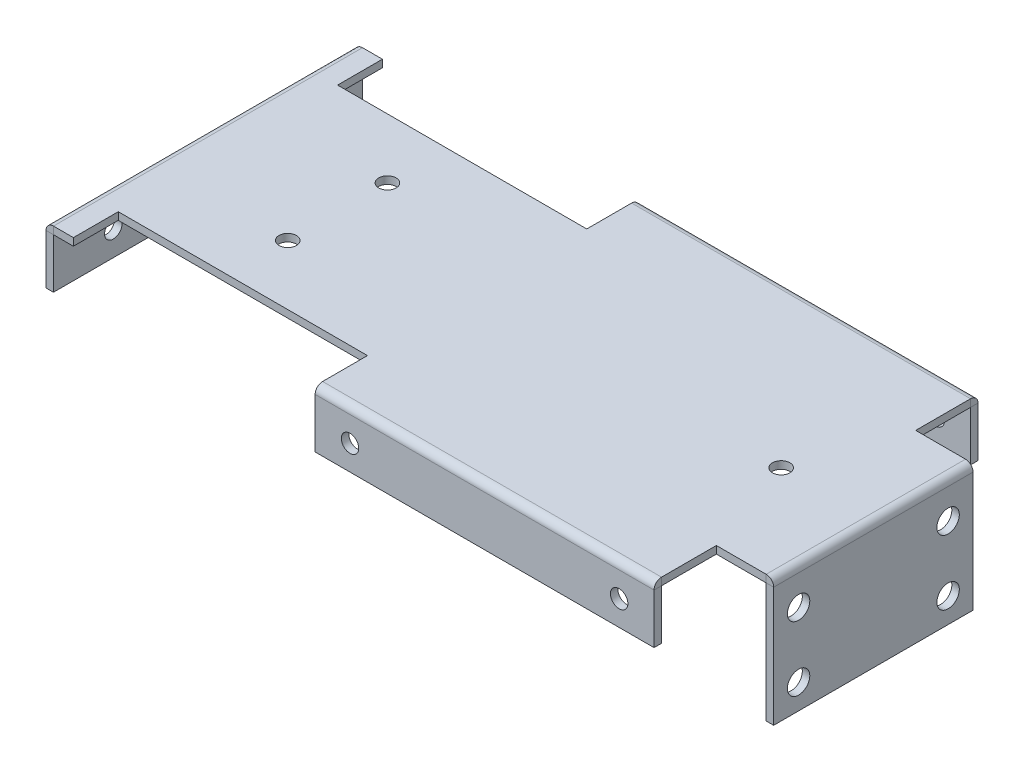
ISO-10303-21;
HEADER;
FILE_DESCRIPTION(('STEP AP214'),'2;1');
FILE_NAME('part.step','',(''),(''),'','','');
FILE_SCHEMA(('AUTOMOTIVE_DESIGN { 1 0 10303 214 1 1 1 1 }'));
ENDSEC;
DATA;
#1=APPLICATION_CONTEXT('core data for automotive mechanical design processes');
#2=APPLICATION_PROTOCOL_DEFINITION('international standard','automotive_design',2000,#1);
#3=PRODUCT_CONTEXT('',#1,'mechanical');
#4=PRODUCT('Part','Part','',(#3));
#5=PRODUCT_RELATED_PRODUCT_CATEGORY('part','',(#4));
#6=PRODUCT_DEFINITION_FORMATION('','',#4);
#7=PRODUCT_DEFINITION_CONTEXT('part definition',#1,'design');
#8=PRODUCT_DEFINITION('design','',#6,#7);
#9=PRODUCT_DEFINITION_SHAPE('','',#8);
#10=(LENGTH_UNIT() NAMED_UNIT(*) SI_UNIT(.MILLI.,.METRE.));
#11=(NAMED_UNIT(*) PLANE_ANGLE_UNIT() SI_UNIT($,.RADIAN.));
#12=(NAMED_UNIT(*) SI_UNIT($,.STERADIAN.) SOLID_ANGLE_UNIT());
#13=UNCERTAINTY_MEASURE_WITH_UNIT(LENGTH_MEASURE(1.E-05),#10,'distance_accuracy_value','');
#14=(GEOMETRIC_REPRESENTATION_CONTEXT(3) GLOBAL_UNCERTAINTY_ASSIGNED_CONTEXT((#13)) GLOBAL_UNIT_ASSIGNED_CONTEXT((#10,
#11,#12)) REPRESENTATION_CONTEXT('',''));
#15=CARTESIAN_POINT('',(0.,0.,0.));
#16=DIRECTION('',(0.,0.,1.));
#17=DIRECTION('',(1.,0.,0.));
#18=AXIS2_PLACEMENT_3D('',#15,#16,#17);
#19=CARTESIAN_POINT('',(14.,0.,-31.));
#20=DIRECTION('',(0.,-1.,0.));
#21=DIRECTION('',(0.,0.,-1.));
#22=AXIS2_PLACEMENT_3D('',#19,#20,#21);
#23=PLANE('',#22);
#24=CARTESIAN_POINT('',(36.,0.,-10.));
#25=DIRECTION('',(0.,1.,0.));
#26=DIRECTION('',(0.,0.,1.));
#27=AXIS2_PLACEMENT_3D('',#24,#25,#26);
#28=CIRCLE('',#27,1.75);
#29=CARTESIAN_POINT('',(36.,0.,-8.25));
#30=VERTEX_POINT('',#29);
#31=EDGE_CURVE('E417',#30,#30,#28,.T.);
#32=ORIENTED_EDGE('',*,*,#31,.T.);
#33=EDGE_LOOP('',(#32));
#34=FACE_BOUND('',#33,.T.);
#35=CARTESIAN_POINT('',(36.,0.,10.));
#36=DIRECTION('',(0.,1.,0.));
#37=DIRECTION('',(0.,0.,-1.));
#38=AXIS2_PLACEMENT_3D('',#35,#36,#37);
#39=CIRCLE('',#38,1.75);
#40=CARTESIAN_POINT('',(36.,0.,8.25));
#41=VERTEX_POINT('',#40);
#42=EDGE_CURVE('E411',#41,#41,#39,.T.);
#43=ORIENTED_EDGE('',*,*,#42,.T.);
#44=EDGE_LOOP('',(#43));
#45=FACE_BOUND('',#44,.T.);
#46=CARTESIAN_POINT('',(125.,0.,0.));
#47=DIRECTION('',(0.,1.,0.));
#48=DIRECTION('',(0.,0.,1.));
#49=AXIS2_PLACEMENT_3D('',#46,#47,#48);
#50=CIRCLE('',#49,1.75000000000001);
#51=CARTESIAN_POINT('',(125.,0.,1.75000000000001));
#52=VERTEX_POINT('',#51);
#53=EDGE_CURVE('E407',#52,#52,#50,.T.);
#54=ORIENTED_EDGE('',*,*,#53,.T.);
#55=EDGE_LOOP('',(#54));
#56=FACE_BOUND('',#55,.T.);
#57=DIRECTION('',(-1.,0.,0.));
#58=VECTOR('',#57,1.);
#59=CARTESIAN_POINT('',(132.,0.,-20.));
#60=LINE('',#59,#58);
#61=CARTESIAN_POINT('',(141.999988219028,0.,-20.));
#62=VERTEX_POINT('',#61);
#63=CARTESIAN_POINT('',(132.,0.,-20.));
#64=VERTEX_POINT('',#63);
#65=EDGE_CURVE('E65',#62,#64,#60,.T.);
#66=ORIENTED_EDGE('',*,*,#65,.F.);
#67=DIRECTION('',(0.,0.,1.));
#68=VECTOR('',#67,1.);
#69=CARTESIAN_POINT('',(141.999988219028,0.,-31.));
#70=LINE('',#69,#68);
#71=CARTESIAN_POINT('',(141.999988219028,0.,20.));
#72=VERTEX_POINT('',#71);
#73=EDGE_CURVE('E57',#62,#72,#70,.T.);
#74=ORIENTED_EDGE('',*,*,#73,.T.);
#75=DIRECTION('',(1.,0.,0.));
#76=VECTOR('',#75,1.);
#77=CARTESIAN_POINT('',(132.,0.,20.));
#78=LINE('',#77,#76);
#79=CARTESIAN_POINT('',(132.,0.,20.));
#80=VERTEX_POINT('',#79);
#81=EDGE_CURVE('E506',#80,#72,#78,.T.);
#82=ORIENTED_EDGE('',*,*,#81,.F.);
#83=DIRECTION('',(0.,0.,-1.));
#84=VECTOR('',#83,1.);
#85=CARTESIAN_POINT('',(132.,0.,41.));
#86=LINE('',#85,#84);
#87=CARTESIAN_POINT('',(132.,0.,30.9999882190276));
#88=VERTEX_POINT('',#87);
#89=EDGE_CURVE('E504',#88,#80,#86,.T.);
#90=ORIENTED_EDGE('',*,*,#89,.F.);
#91=DIRECTION('',(1.,0.,0.));
#92=VECTOR('',#91,1.);
#93=CARTESIAN_POINT('',(14.,0.,30.9999882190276));
#94=LINE('',#93,#92);
#95=CARTESIAN_POINT('',(64.,0.,30.9999882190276));
#96=VERTEX_POINT('',#95);
#97=EDGE_CURVE('E497',#96,#88,#94,.T.);
#98=ORIENTED_EDGE('',*,*,#97,.F.);
#99=DIRECTION('',(0.,0.,1.));
#100=VECTOR('',#99,1.);
#101=CARTESIAN_POINT('',(64.,0.,22.));
#102=LINE('',#101,#100);
#103=CARTESIAN_POINT('',(64.,0.,22.));
#104=VERTEX_POINT('',#103);
#105=EDGE_CURVE('E443',#104,#96,#102,.T.);
#106=ORIENTED_EDGE('',*,*,#105,.F.);
#107=DIRECTION('',(1.,0.,0.));
#108=VECTOR('',#107,1.);
#109=CARTESIAN_POINT('',(14.,0.,22.));
#110=LINE('',#109,#108);
#111=CARTESIAN_POINT('',(14.,0.,22.));
#112=VERTEX_POINT('',#111);
#113=EDGE_CURVE('E440',#112,#104,#110,.T.);
#114=ORIENTED_EDGE('',*,*,#113,.F.);
#115=DIRECTION('',(0.,0.,-1.));
#116=VECTOR('',#115,1.);
#117=CARTESIAN_POINT('',(14.,0.,31.));
#118=LINE('',#117,#116);
#119=CARTESIAN_POINT('',(14.,0.,31.));
#120=VERTEX_POINT('',#119);
#121=EDGE_CURVE('E438',#120,#112,#118,.T.);
#122=ORIENTED_EDGE('',*,*,#121,.F.);
#123=DIRECTION('',(1.,0.,0.));
#124=VECTOR('',#123,1.);
#125=CARTESIAN_POINT('',(0.,0.,31.));
#126=LINE('',#125,#124);
#127=CARTESIAN_POINT('',(10.0000117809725,0.,31.));
#128=VERTEX_POINT('',#127);
#129=EDGE_CURVE('E441',#128,#120,#126,.T.);
#130=ORIENTED_EDGE('',*,*,#129,.F.);
#131=DIRECTION('',(0.,0.,1.));
#132=VECTOR('',#131,1.);
#133=CARTESIAN_POINT('',(10.0000117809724,0.,-31.));
#134=LINE('',#133,#132);
#135=CARTESIAN_POINT('',(10.0000117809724,0.,-31.));
#136=VERTEX_POINT('',#135);
#137=EDGE_CURVE('E518',#136,#128,#134,.T.);
#138=ORIENTED_EDGE('',*,*,#137,.F.);
#139=DIRECTION('',(-1.,0.,0.));
#140=VECTOR('',#139,1.);
#141=CARTESIAN_POINT('',(0.,0.,-31.));
#142=LINE('',#141,#140);
#143=CARTESIAN_POINT('',(14.,0.,-31.));
#144=VERTEX_POINT('',#143);
#145=EDGE_CURVE('E423',#144,#136,#142,.T.);
#146=ORIENTED_EDGE('',*,*,#145,.F.);
#147=DIRECTION('',(0.,0.,-1.));
#148=VECTOR('',#147,1.);
#149=CARTESIAN_POINT('',(14.,0.,-31.));
#150=LINE('',#149,#148);
#151=CARTESIAN_POINT('',(14.,0.,-22.));
#152=VERTEX_POINT('',#151);
#153=EDGE_CURVE('E446',#152,#144,#150,.T.);
#154=ORIENTED_EDGE('',*,*,#153,.F.);
#155=DIRECTION('',(-1.,0.,0.));
#156=VECTOR('',#155,1.);
#157=CARTESIAN_POINT('',(14.,0.,-22.));
#158=LINE('',#157,#156);
#159=CARTESIAN_POINT('',(64.,0.,-22.));
#160=VERTEX_POINT('',#159);
#161=EDGE_CURVE('E444',#160,#152,#158,.T.);
#162=ORIENTED_EDGE('',*,*,#161,.F.);
#163=DIRECTION('',(0.,0.,1.));
#164=VECTOR('',#163,1.);
#165=CARTESIAN_POINT('',(64.,0.,-22.));
#166=LINE('',#165,#164);
#167=CARTESIAN_POINT('',(64.,0.,-30.9999882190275));
#168=VERTEX_POINT('',#167);
#169=EDGE_CURVE('E447',#168,#160,#166,.T.);
#170=ORIENTED_EDGE('',*,*,#169,.F.);
#171=DIRECTION('',(1.,0.,0.));
#172=VECTOR('',#171,1.);
#173=CARTESIAN_POINT('',(14.,0.,-30.9999882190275));
#174=LINE('',#173,#172);
#175=CARTESIAN_POINT('',(132.,0.,-30.9999882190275));
#176=VERTEX_POINT('',#175);
#177=EDGE_CURVE('E478',#168,#176,#174,.T.);
#178=ORIENTED_EDGE('',*,*,#177,.T.);
#179=DIRECTION('',(0.,0.,-1.));
#180=VECTOR('',#179,1.);
#181=CARTESIAN_POINT('',(132.,0.,-41.));
#182=LINE('',#181,#180);
#183=EDGE_CURVE('E486',#64,#176,#182,.T.);
#184=ORIENTED_EDGE('',*,*,#183,.F.);
#185=EDGE_LOOP('',(#66,#74,#82,#90,#98,#106,#114,#122,#130,#138,#146,#154,#162,#170,#178,#184));
#186=FACE_BOUND('',#185,.T.);
#187=ADVANCED_FACE('F48',(#34,#45,#56,#186),#23,.T.);
#188=CARTESIAN_POINT('',(0.,1.5,31.));
#189=DIRECTION('',(0.,0.,-1.));
#190=DIRECTION('',(-1.,0.,0.));
#191=AXIS2_PLACEMENT_3D('',#188,#189,#190);
#192=PLANE('',#191);
#193=DIRECTION('',(1.,0.,0.));
#194=VECTOR('',#193,1.);
#195=CARTESIAN_POINT('',(0.,1.5,31.));
#196=LINE('',#195,#194);
#197=CARTESIAN_POINT('',(10.0000117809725,1.5,31.));
#198=VERTEX_POINT('',#197);
#199=CARTESIAN_POINT('',(14.,1.5,31.));
#200=VERTEX_POINT('',#199);
#201=EDGE_CURVE('E429',#198,#200,#196,.T.);
#202=ORIENTED_EDGE('',*,*,#201,.F.);
#203=DIRECTION('',(0.,-1.,0.));
#204=VECTOR('',#203,1.);
#205=CARTESIAN_POINT('',(10.0000117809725,1.5,31.));
#206=LINE('',#205,#204);
#207=EDGE_CURVE('E521',#198,#128,#206,.T.);
#208=ORIENTED_EDGE('',*,*,#207,.T.);
#209=ORIENTED_EDGE('',*,*,#129,.T.);
#210=DIRECTION('',(0.,-1.,0.));
#211=VECTOR('',#210,1.);
#212=CARTESIAN_POINT('',(14.,1.5,31.));
#213=LINE('',#212,#211);
#214=EDGE_CURVE('E470',#200,#120,#213,.T.);
#215=ORIENTED_EDGE('',*,*,#214,.F.);
#216=EDGE_LOOP('',(#202,#208,#209,#215));
#217=FACE_BOUND('',#216,.T.);
#218=ADVANCED_FACE('F590',(#217),#192,.F.);
#219=CARTESIAN_POINT('',(0.,1.5,-31.));
#220=DIRECTION('',(0.,0.,1.));
#221=DIRECTION('',(1.,0.,0.));
#222=AXIS2_PLACEMENT_3D('',#219,#220,#221);
#223=PLANE('',#222);
#224=ORIENTED_EDGE('',*,*,#145,.T.);
#225=DIRECTION('',(0.,1.,0.));
#226=VECTOR('',#225,1.);
#227=CARTESIAN_POINT('',(10.0000117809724,1.5,-31.));
#228=LINE('',#227,#226);
#229=CARTESIAN_POINT('',(10.0000117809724,1.5,-31.));
#230=VERTEX_POINT('',#229);
#231=EDGE_CURVE('E515',#136,#230,#228,.T.);
#232=ORIENTED_EDGE('',*,*,#231,.T.);
#233=DIRECTION('',(-1.,0.,0.));
#234=VECTOR('',#233,1.);
#235=CARTESIAN_POINT('',(0.,1.5,-31.));
#236=LINE('',#235,#234);
#237=CARTESIAN_POINT('',(14.,1.5,-31.));
#238=VERTEX_POINT('',#237);
#239=EDGE_CURVE('E449',#238,#230,#236,.T.);
#240=ORIENTED_EDGE('',*,*,#239,.F.);
#241=DIRECTION('',(0.,-1.,0.));
#242=VECTOR('',#241,1.);
#243=CARTESIAN_POINT('',(14.,1.5,-31.));
#244=LINE('',#243,#242);
#245=EDGE_CURVE('E437',#238,#144,#244,.T.);
#246=ORIENTED_EDGE('',*,*,#245,.T.);
#247=EDGE_LOOP('',(#224,#232,#240,#246));
#248=FACE_BOUND('',#247,.T.);
#249=ADVANCED_FACE('F573',(#248),#223,.F.);
#250=CARTESIAN_POINT('',(14.,1.5,-31.));
#251=DIRECTION('',(0.,-1.,0.));
#252=DIRECTION('',(0.,0.,-1.));
#253=AXIS2_PLACEMENT_3D('',#250,#251,#252);
#254=PLANE('',#253);
#255=DIRECTION('',(0.,0.,1.));
#256=VECTOR('',#255,1.);
#257=CARTESIAN_POINT('',(141.999988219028,1.5,-31.));
#258=LINE('',#257,#256);
#259=CARTESIAN_POINT('',(141.999988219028,1.5,-20.));
#260=VERTEX_POINT('',#259);
#261=CARTESIAN_POINT('',(141.999988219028,1.5,20.));
#262=VERTEX_POINT('',#261);
#263=EDGE_CURVE('E524',#260,#262,#258,.T.);
#264=ORIENTED_EDGE('',*,*,#263,.F.);
#265=DIRECTION('',(-1.,0.,0.));
#266=VECTOR('',#265,1.);
#267=CARTESIAN_POINT('',(132.,1.5,-20.));
#268=LINE('',#267,#266);
#269=CARTESIAN_POINT('',(132.,1.5,-20.));
#270=VERTEX_POINT('',#269);
#271=EDGE_CURVE('E52',#260,#270,#268,.T.);
#272=ORIENTED_EDGE('',*,*,#271,.T.);
#273=DIRECTION('',(0.,0.,-1.));
#274=VECTOR('',#273,1.);
#275=CARTESIAN_POINT('',(132.,1.5,-41.));
#276=LINE('',#275,#274);
#277=CARTESIAN_POINT('',(132.,1.5,-30.9999882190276));
#278=VERTEX_POINT('',#277);
#279=EDGE_CURVE('E489',#270,#278,#276,.T.);
#280=ORIENTED_EDGE('',*,*,#279,.T.);
#281=DIRECTION('',(1.,0.,0.));
#282=VECTOR('',#281,1.);
#283=CARTESIAN_POINT('',(14.,1.5,-30.9999882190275));
#284=LINE('',#283,#282);
#285=CARTESIAN_POINT('',(64.,1.5,-30.9999882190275));
#286=VERTEX_POINT('',#285);
#287=EDGE_CURVE('E473',#286,#278,#284,.T.);
#288=ORIENTED_EDGE('',*,*,#287,.F.);
#289=DIRECTION('',(0.,0.,1.));
#290=VECTOR('',#289,1.);
#291=CARTESIAN_POINT('',(64.,1.5,-22.));
#292=LINE('',#291,#290);
#293=CARTESIAN_POINT('',(64.,1.5,-22.));
#294=VERTEX_POINT('',#293);
#295=EDGE_CURVE('E435',#286,#294,#292,.T.);
#296=ORIENTED_EDGE('',*,*,#295,.T.);
#297=DIRECTION('',(-1.,0.,0.));
#298=VECTOR('',#297,1.);
#299=CARTESIAN_POINT('',(14.,1.5,-22.));
#300=LINE('',#299,#298);
#301=CARTESIAN_POINT('',(14.,1.5,-22.));
#302=VERTEX_POINT('',#301);
#303=EDGE_CURVE('E432',#294,#302,#300,.T.);
#304=ORIENTED_EDGE('',*,*,#303,.T.);
#305=DIRECTION('',(0.,0.,-1.));
#306=VECTOR('',#305,1.);
#307=CARTESIAN_POINT('',(14.,1.5,-31.));
#308=LINE('',#307,#306);
#309=EDGE_CURVE('E434',#302,#238,#308,.T.);
#310=ORIENTED_EDGE('',*,*,#309,.T.);
#311=ORIENTED_EDGE('',*,*,#239,.T.);
#312=DIRECTION('',(0.,0.,1.));
#313=VECTOR('',#312,1.);
#314=CARTESIAN_POINT('',(10.0000117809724,1.5,-31.));
#315=LINE('',#314,#313);
#316=EDGE_CURVE('E503',#230,#198,#315,.T.);
#317=ORIENTED_EDGE('',*,*,#316,.T.);
#318=ORIENTED_EDGE('',*,*,#201,.T.);
#319=DIRECTION('',(0.,0.,-1.));
#320=VECTOR('',#319,1.);
#321=CARTESIAN_POINT('',(14.,1.5,31.));
#322=LINE('',#321,#320);
#323=CARTESIAN_POINT('',(14.,1.5,22.));
#324=VERTEX_POINT('',#323);
#325=EDGE_CURVE('E426',#200,#324,#322,.T.);
#326=ORIENTED_EDGE('',*,*,#325,.T.);
#327=DIRECTION('',(1.,0.,0.));
#328=VECTOR('',#327,1.);
#329=CARTESIAN_POINT('',(14.,1.5,22.));
#330=LINE('',#329,#328);
#331=CARTESIAN_POINT('',(64.,1.5,22.));
#332=VERTEX_POINT('',#331);
#333=EDGE_CURVE('E428',#324,#332,#330,.T.);
#334=ORIENTED_EDGE('',*,*,#333,.T.);
#335=DIRECTION('',(0.,0.,1.));
#336=VECTOR('',#335,1.);
#337=CARTESIAN_POINT('',(64.,1.5,22.));
#338=LINE('',#337,#336);
#339=CARTESIAN_POINT('',(64.,1.5,30.9999882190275));
#340=VERTEX_POINT('',#339);
#341=EDGE_CURVE('E431',#332,#340,#338,.T.);
#342=ORIENTED_EDGE('',*,*,#341,.T.);
#343=DIRECTION('',(1.,0.,0.));
#344=VECTOR('',#343,1.);
#345=CARTESIAN_POINT('',(14.,1.5,30.9999882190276));
#346=LINE('',#345,#344);
#347=CARTESIAN_POINT('',(132.,1.5,30.9999882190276));
#348=VERTEX_POINT('',#347);
#349=EDGE_CURVE('E484',#340,#348,#346,.T.);
#350=ORIENTED_EDGE('',*,*,#349,.T.);
#351=DIRECTION('',(0.,0.,-1.));
#352=VECTOR('',#351,1.);
#353=CARTESIAN_POINT('',(132.,1.5,41.));
#354=LINE('',#353,#352);
#355=CARTESIAN_POINT('',(132.,1.5,20.));
#356=VERTEX_POINT('',#355);
#357=EDGE_CURVE('E509',#348,#356,#354,.T.);
#358=ORIENTED_EDGE('',*,*,#357,.T.);
#359=DIRECTION('',(1.,0.,0.));
#360=VECTOR('',#359,1.);
#361=CARTESIAN_POINT('',(132.,1.5,20.));
#362=LINE('',#361,#360);
#363=EDGE_CURVE('E73',#356,#262,#362,.T.);
#364=ORIENTED_EDGE('',*,*,#363,.T.);
#365=EDGE_LOOP('',(#264,#272,#280,#288,#296,#304,#310,#311,#317,#318,#326,#334,#342,#350,#358,#364));
#366=FACE_BOUND('',#365,.T.);
#367=CARTESIAN_POINT('',(36.,1.5,-10.));
#368=DIRECTION('',(0.,1.,0.));
#369=DIRECTION('',(0.,0.,1.));
#370=AXIS2_PLACEMENT_3D('',#367,#368,#369);
#371=CIRCLE('',#370,1.75);
#372=CARTESIAN_POINT('',(36.,1.5,-8.25));
#373=VERTEX_POINT('',#372);
#374=EDGE_CURVE('E420',#373,#373,#371,.T.);
#375=ORIENTED_EDGE('',*,*,#374,.F.);
#376=EDGE_LOOP('',(#375));
#377=FACE_BOUND('',#376,.T.);
#378=CARTESIAN_POINT('',(36.,1.5,10.));
#379=DIRECTION('',(0.,1.,0.));
#380=DIRECTION('',(0.,0.,-1.));
#381=AXIS2_PLACEMENT_3D('',#378,#379,#380);
#382=CIRCLE('',#381,1.75);
#383=CARTESIAN_POINT('',(36.,1.5,8.25));
#384=VERTEX_POINT('',#383);
#385=EDGE_CURVE('E414',#384,#384,#382,.T.);
#386=ORIENTED_EDGE('',*,*,#385,.F.);
#387=EDGE_LOOP('',(#386));
#388=FACE_BOUND('',#387,.T.);
#389=CARTESIAN_POINT('',(125.,1.5,0.));
#390=DIRECTION('',(0.,1.,0.));
#391=DIRECTION('',(0.,0.,1.));
#392=AXIS2_PLACEMENT_3D('',#389,#390,#391);
#393=CIRCLE('',#392,1.75000000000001);
#394=CARTESIAN_POINT('',(125.,1.5,1.75000000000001));
#395=VERTEX_POINT('',#394);
#396=EDGE_CURVE('E408',#395,#395,#393,.T.);
#397=ORIENTED_EDGE('',*,*,#396,.F.);
#398=EDGE_LOOP('',(#397));
#399=FACE_BOUND('',#398,.T.);
#400=ADVANCED_FACE('F539',(#366,#377,#388,#399),#254,.F.);
#401=CARTESIAN_POINT('',(132.,1.5,41.));
#402=DIRECTION('',(-1.,0.,0.));
#403=DIRECTION('',(0.,0.,1.));
#404=AXIS2_PLACEMENT_3D('',#401,#402,#403);
#405=PLANE('',#404);
#406=ORIENTED_EDGE('',*,*,#357,.F.);
#407=DIRECTION('',(0.,-1.,0.));
#408=VECTOR('',#407,1.);
#409=CARTESIAN_POINT('',(132.,1.5,30.9999882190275));
#410=LINE('',#409,#408);
#411=EDGE_CURVE('E500',#348,#88,#410,.T.);
#412=ORIENTED_EDGE('',*,*,#411,.T.);
#413=ORIENTED_EDGE('',*,*,#89,.T.);
#414=DIRECTION('',(0.,-1.,0.));
#415=VECTOR('',#414,1.);
#416=CARTESIAN_POINT('',(132.,1.5,20.));
#417=LINE('',#416,#415);
#418=EDGE_CURVE('E461',#356,#80,#417,.T.);
#419=ORIENTED_EDGE('',*,*,#418,.F.);
#420=EDGE_LOOP('',(#406,#412,#413,#419));
#421=FACE_BOUND('',#420,.T.);
#422=ADVANCED_FACE('F613',(#421),#405,.F.);
#423=CARTESIAN_POINT('',(64.,1.5,22.));
#424=DIRECTION('',(1.,0.,0.));
#425=DIRECTION('',(0.,0.,-1.));
#426=AXIS2_PLACEMENT_3D('',#423,#424,#425);
#427=PLANE('',#426);
#428=ORIENTED_EDGE('',*,*,#105,.T.);
#429=DIRECTION('',(0.,1.,0.));
#430=VECTOR('',#429,1.);
#431=CARTESIAN_POINT('',(64.,1.5,30.9999882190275));
#432=LINE('',#431,#430);
#433=EDGE_CURVE('E494',#96,#340,#432,.T.);
#434=ORIENTED_EDGE('',*,*,#433,.T.);
#435=ORIENTED_EDGE('',*,*,#341,.F.);
#436=DIRECTION('',(0.,-1.,0.));
#437=VECTOR('',#436,1.);
#438=CARTESIAN_POINT('',(64.,1.5,22.));
#439=LINE('',#438,#437);
#440=EDGE_CURVE('E464',#332,#104,#439,.T.);
#441=ORIENTED_EDGE('',*,*,#440,.T.);
#442=EDGE_LOOP('',(#428,#434,#435,#441));
#443=FACE_BOUND('',#442,.T.);
#444=ADVANCED_FACE('F605',(#443),#427,.F.);
#445=CARTESIAN_POINT('',(14.,1.5,31.));
#446=DIRECTION('',(-1.,0.,0.));
#447=DIRECTION('',(0.,0.,1.));
#448=AXIS2_PLACEMENT_3D('',#445,#446,#447);
#449=PLANE('',#448);
#450=ORIENTED_EDGE('',*,*,#121,.T.);
#451=DIRECTION('',(0.,-1.,0.));
#452=VECTOR('',#451,1.);
#453=CARTESIAN_POINT('',(14.,1.5,22.));
#454=LINE('',#453,#452);
#455=EDGE_CURVE('E467',#324,#112,#454,.T.);
#456=ORIENTED_EDGE('',*,*,#455,.F.);
#457=ORIENTED_EDGE('',*,*,#325,.F.);
#458=ORIENTED_EDGE('',*,*,#214,.T.);
#459=EDGE_LOOP('',(#450,#456,#457,#458));
#460=FACE_BOUND('',#459,.T.);
#461=ADVANCED_FACE('F597',(#460),#449,.F.);
#462=CARTESIAN_POINT('',(14.,1.5,22.));
#463=DIRECTION('',(0.,0.,-1.));
#464=DIRECTION('',(-1.,0.,0.));
#465=AXIS2_PLACEMENT_3D('',#462,#463,#464);
#466=PLANE('',#465);
#467=ORIENTED_EDGE('',*,*,#113,.T.);
#468=ORIENTED_EDGE('',*,*,#440,.F.);
#469=ORIENTED_EDGE('',*,*,#333,.F.);
#470=ORIENTED_EDGE('',*,*,#455,.T.);
#471=EDGE_LOOP('',(#467,#468,#469,#470));
#472=FACE_BOUND('',#471,.T.);
#473=ADVANCED_FACE('F601',(#472),#466,.F.);
#474=CARTESIAN_POINT('',(132.,1.5,20.));
#475=DIRECTION('',(0.,0.,-1.));
#476=DIRECTION('',(-1.,0.,0.));
#477=AXIS2_PLACEMENT_3D('',#474,#475,#476);
#478=PLANE('',#477);
#479=DIRECTION('',(0.,-1.,0.));
#480=VECTOR('',#479,1.);
#481=CARTESIAN_POINT('',(141.999988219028,1.5,20.));
#482=LINE('',#481,#480);
#483=EDGE_CURVE('E533',#262,#72,#482,.T.);
#484=ORIENTED_EDGE('',*,*,#483,.F.);
#485=ORIENTED_EDGE('',*,*,#363,.F.);
#486=ORIENTED_EDGE('',*,*,#418,.T.);
#487=ORIENTED_EDGE('',*,*,#81,.T.);
#488=EDGE_LOOP('',(#484,#485,#486,#487));
#489=FACE_BOUND('',#488,.T.);
#490=ADVANCED_FACE('F618',(#489),#478,.F.);
#491=CARTESIAN_POINT('',(132.,1.5,-20.));
#492=DIRECTION('',(0.,0.,1.));
#493=DIRECTION('',(1.,0.,0.));
#494=AXIS2_PLACEMENT_3D('',#491,#492,#493);
#495=PLANE('',#494);
#496=DIRECTION('',(0.,1.,0.));
#497=VECTOR('',#496,1.);
#498=CARTESIAN_POINT('',(141.999988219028,1.5,-20.));
#499=LINE('',#498,#497);
#500=EDGE_CURVE('E12',#62,#260,#499,.T.);
#501=ORIENTED_EDGE('',*,*,#500,.F.);
#502=ORIENTED_EDGE('',*,*,#65,.T.);
#503=DIRECTION('',(0.,-1.,0.));
#504=VECTOR('',#503,1.);
#505=CARTESIAN_POINT('',(132.,1.5,-20.));
#506=LINE('',#505,#504);
#507=EDGE_CURVE('E458',#270,#64,#506,.T.);
#508=ORIENTED_EDGE('',*,*,#507,.F.);
#509=ORIENTED_EDGE('',*,*,#271,.F.);
#510=EDGE_LOOP('',(#501,#502,#508,#509));
#511=FACE_BOUND('',#510,.T.);
#512=ADVANCED_FACE('F50',(#511),#495,.F.);
#513=CARTESIAN_POINT('',(132.,1.5,-41.));
#514=DIRECTION('',(-1.,0.,0.));
#515=DIRECTION('',(0.,0.,1.));
#516=AXIS2_PLACEMENT_3D('',#513,#514,#515);
#517=PLANE('',#516);
#518=DIRECTION('',(0.,-1.,0.));
#519=VECTOR('',#518,1.);
#520=CARTESIAN_POINT('',(132.,1.5,-30.9999882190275));
#521=LINE('',#520,#519);
#522=EDGE_CURVE('E476',#278,#176,#521,.T.);
#523=ORIENTED_EDGE('',*,*,#522,.F.);
#524=ORIENTED_EDGE('',*,*,#279,.F.);
#525=ORIENTED_EDGE('',*,*,#507,.T.);
#526=ORIENTED_EDGE('',*,*,#183,.T.);
#527=EDGE_LOOP('',(#523,#524,#525,#526));
#528=FACE_BOUND('',#527,.T.);
#529=ADVANCED_FACE('F546',(#528),#517,.F.);
#530=CARTESIAN_POINT('',(64.,1.5,-22.));
#531=DIRECTION('',(1.,0.,0.));
#532=DIRECTION('',(0.,0.,-1.));
#533=AXIS2_PLACEMENT_3D('',#530,#531,#532);
#534=PLANE('',#533);
#535=DIRECTION('',(0.,1.,0.));
#536=VECTOR('',#535,1.);
#537=CARTESIAN_POINT('',(64.,1.5,-30.9999882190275));
#538=LINE('',#537,#536);
#539=EDGE_CURVE('E481',#168,#286,#538,.T.);
#540=ORIENTED_EDGE('',*,*,#539,.F.);
#541=ORIENTED_EDGE('',*,*,#169,.T.);
#542=DIRECTION('',(0.,-1.,0.));
#543=VECTOR('',#542,1.);
#544=CARTESIAN_POINT('',(64.,1.5,-22.));
#545=LINE('',#544,#543);
#546=EDGE_CURVE('E455',#294,#160,#545,.T.);
#547=ORIENTED_EDGE('',*,*,#546,.F.);
#548=ORIENTED_EDGE('',*,*,#295,.F.);
#549=EDGE_LOOP('',(#540,#541,#547,#548));
#550=FACE_BOUND('',#549,.T.);
#551=ADVANCED_FACE('F559',(#550),#534,.F.);
#552=CARTESIAN_POINT('',(14.,1.5,-22.));
#553=DIRECTION('',(0.,0.,1.));
#554=DIRECTION('',(1.,0.,0.));
#555=AXIS2_PLACEMENT_3D('',#552,#553,#554);
#556=PLANE('',#555);
#557=ORIENTED_EDGE('',*,*,#161,.T.);
#558=DIRECTION('',(0.,-1.,0.));
#559=VECTOR('',#558,1.);
#560=CARTESIAN_POINT('',(14.,1.5,-22.));
#561=LINE('',#560,#559);
#562=EDGE_CURVE('E452',#302,#152,#561,.T.);
#563=ORIENTED_EDGE('',*,*,#562,.F.);
#564=ORIENTED_EDGE('',*,*,#303,.F.);
#565=ORIENTED_EDGE('',*,*,#546,.T.);
#566=EDGE_LOOP('',(#557,#563,#564,#565));
#567=FACE_BOUND('',#566,.T.);
#568=ADVANCED_FACE('F562',(#567),#556,.F.);
#569=CARTESIAN_POINT('',(14.,1.5,-31.));
#570=DIRECTION('',(-1.,0.,0.));
#571=DIRECTION('',(0.,0.,1.));
#572=AXIS2_PLACEMENT_3D('',#569,#570,#571);
#573=PLANE('',#572);
#574=ORIENTED_EDGE('',*,*,#153,.T.);
#575=ORIENTED_EDGE('',*,*,#245,.F.);
#576=ORIENTED_EDGE('',*,*,#309,.F.);
#577=ORIENTED_EDGE('',*,*,#562,.T.);
#578=EDGE_LOOP('',(#574,#575,#576,#577));
#579=FACE_BOUND('',#578,.T.);
#580=ADVANCED_FACE('F567',(#579),#573,.F.);
#581=CARTESIAN_POINT('',(36.,1.5,-10.));
#582=DIRECTION('',(0.,-1.,0.));
#583=DIRECTION('',(0.,0.,-1.));
#584=AXIS2_PLACEMENT_3D('',#581,#582,#583);
#585=CYLINDRICAL_SURFACE('',#584,1.75);
#586=ORIENTED_EDGE('',*,*,#374,.T.);
#587=EDGE_LOOP('',(#586));
#588=FACE_BOUND('',#587,.T.);
#589=ORIENTED_EDGE('',*,*,#31,.F.);
#590=EDGE_LOOP('',(#589));
#591=FACE_BOUND('',#590,.T.);
#592=ADVANCED_FACE('F717',(#588,#591),#585,.F.);
#593=CARTESIAN_POINT('',(36.,1.5,10.));
#594=DIRECTION('',(0.,-1.,0.));
#595=DIRECTION('',(0.,0.,-1.));
#596=AXIS2_PLACEMENT_3D('',#593,#594,#595);
#597=CYLINDRICAL_SURFACE('',#596,1.75);
#598=ORIENTED_EDGE('',*,*,#385,.T.);
#599=EDGE_LOOP('',(#598));
#600=FACE_BOUND('',#599,.T.);
#601=ORIENTED_EDGE('',*,*,#42,.F.);
#602=EDGE_LOOP('',(#601));
#603=FACE_BOUND('',#602,.T.);
#604=ADVANCED_FACE('F720',(#600,#603),#597,.F.);
#605=CARTESIAN_POINT('',(125.,1.5,0.));
#606=DIRECTION('',(0.,-1.,0.));
#607=DIRECTION('',(0.,0.,-1.));
#608=AXIS2_PLACEMENT_3D('',#605,#606,#607);
#609=CYLINDRICAL_SURFACE('',#608,1.75000000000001);
#610=ORIENTED_EDGE('',*,*,#396,.T.);
#611=EDGE_LOOP('',(#610));
#612=FACE_BOUND('',#611,.T.);
#613=ORIENTED_EDGE('',*,*,#53,.F.);
#614=EDGE_LOOP('',(#613));
#615=FACE_BOUND('',#614,.T.);
#616=ADVANCED_FACE('F724',(#612,#615),#609,.F.);
#617=CARTESIAN_POINT('',(132.,0.,-30.9999882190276));
#618=DIRECTION('',(1.,0.,0.));
#619=DIRECTION('',(0.,0.,-1.));
#620=AXIS2_PLACEMENT_3D('',#617,#618,#619);
#621=CYLINDRICAL_SURFACE('',#620,1.5);
#622=CARTESIAN_POINT('',(132.,0.,-30.9999882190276));
#623=DIRECTION('',(1.,0.,0.));
#624=DIRECTION('',(0.,0.,-1.));
#625=AXIS2_PLACEMENT_3D('',#622,#623,#624);
#626=CIRCLE('',#625,1.5);
#627=CARTESIAN_POINT('',(132.,0.,-32.4999882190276));
#628=VERTEX_POINT('',#627);
#629=EDGE_CURVE('E404',#628,#278,#626,.T.);
#630=ORIENTED_EDGE('',*,*,#629,.F.);
#631=DIRECTION('',(1.,0.,0.));
#632=VECTOR('',#631,1.);
#633=CARTESIAN_POINT('',(14.,0.,-32.4999882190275));
#634=LINE('',#633,#632);
#635=CARTESIAN_POINT('',(64.,0.,-32.4999882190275));
#636=VERTEX_POINT('',#635);
#637=EDGE_CURVE('E386',#636,#628,#634,.T.);
#638=ORIENTED_EDGE('',*,*,#637,.F.);
#639=CARTESIAN_POINT('',(64.,0.,-30.9999882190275));
#640=DIRECTION('',(1.,0.,0.));
#641=DIRECTION('',(0.,0.,-1.));
#642=AXIS2_PLACEMENT_3D('',#639,#640,#641);
#643=CIRCLE('',#642,1.5);
#644=EDGE_CURVE('E364',#636,#286,#643,.T.);
#645=ORIENTED_EDGE('',*,*,#644,.T.);
#646=ORIENTED_EDGE('',*,*,#287,.T.);
#647=EDGE_LOOP('',(#630,#638,#645,#646));
#648=FACE_BOUND('',#647,.T.);
#649=ADVANCED_FACE('F553',(#648),#621,.T.);
#650=CARTESIAN_POINT('',(132.,0.,-32.4999882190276));
#651=DIRECTION('',(-1.,0.,0.));
#652=DIRECTION('',(0.,0.,1.));
#653=AXIS2_PLACEMENT_3D('',#650,#651,#652);
#654=PLANE('',#653);
#655=ORIENTED_EDGE('',*,*,#522,.T.);
#656=DIRECTION('',(0.,0.,1.));
#657=VECTOR('',#656,1.);
#658=CARTESIAN_POINT('',(132.,0.,-32.4999882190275));
#659=LINE('',#658,#657);
#660=EDGE_CURVE('E379',#628,#176,#659,.T.);
#661=ORIENTED_EDGE('',*,*,#660,.F.);
#662=ORIENTED_EDGE('',*,*,#629,.T.);
#663=EDGE_LOOP('',(#655,#661,#662));
#664=FACE_BOUND('',#663,.T.);
#665=ADVANCED_FACE('F550',(#664),#654,.F.);
#666=CARTESIAN_POINT('',(64.,0.,-32.4999882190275));
#667=DIRECTION('',(1.,0.,0.));
#668=DIRECTION('',(0.,0.,-1.));
#669=AXIS2_PLACEMENT_3D('',#666,#667,#668);
#670=PLANE('',#669);
#671=DIRECTION('',(0.,0.,-1.));
#672=VECTOR('',#671,1.);
#673=CARTESIAN_POINT('',(64.,0.,-32.4999882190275));
#674=LINE('',#673,#672);
#675=EDGE_CURVE('E365',#168,#636,#674,.T.);
#676=ORIENTED_EDGE('',*,*,#675,.F.);
#677=ORIENTED_EDGE('',*,*,#539,.T.);
#678=ORIENTED_EDGE('',*,*,#644,.F.);
#679=EDGE_LOOP('',(#676,#677,#678));
#680=FACE_BOUND('',#679,.T.);
#681=ADVANCED_FACE('F731',(#680),#670,.F.);
#682=CARTESIAN_POINT('',(64.,-9.99998821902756,-32.4999882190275));
#683=DIRECTION('',(0.,1.,0.));
#684=DIRECTION('',(1.,0.,0.));
#685=AXIS2_PLACEMENT_3D('',#682,#683,#684);
#686=PLANE('',#685);
#687=DIRECTION('',(-1.,0.,0.));
#688=VECTOR('',#687,1.);
#689=CARTESIAN_POINT('',(64.,-9.99998821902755,-30.9999882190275));
#690=LINE('',#689,#688);
#691=CARTESIAN_POINT('',(132.,-9.99998821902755,-30.9999882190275));
#692=VERTEX_POINT('',#691);
#693=CARTESIAN_POINT('',(64.,-9.99998821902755,-30.9999882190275));
#694=VERTEX_POINT('',#693);
#695=EDGE_CURVE('E360',#692,#694,#690,.T.);
#696=ORIENTED_EDGE('',*,*,#695,.T.);
#697=DIRECTION('',(0.,0.,1.));
#698=VECTOR('',#697,1.);
#699=CARTESIAN_POINT('',(64.,-9.99998821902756,-32.4999882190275));
#700=LINE('',#699,#698);
#701=CARTESIAN_POINT('',(64.,-9.99998821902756,-32.4999882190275));
#702=VERTEX_POINT('',#701);
#703=EDGE_CURVE('E361',#702,#694,#700,.T.);
#704=ORIENTED_EDGE('',*,*,#703,.F.);
#705=DIRECTION('',(-1.,0.,0.));
#706=VECTOR('',#705,1.);
#707=CARTESIAN_POINT('',(64.,-9.99998821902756,-32.4999882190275));
#708=LINE('',#707,#706);
#709=CARTESIAN_POINT('',(132.,-9.99998821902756,-32.4999882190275));
#710=VERTEX_POINT('',#709);
#711=EDGE_CURVE('E382',#710,#702,#708,.T.);
#712=ORIENTED_EDGE('',*,*,#711,.F.);
#713=DIRECTION('',(0.,0.,1.));
#714=VECTOR('',#713,1.);
#715=CARTESIAN_POINT('',(132.,-9.99998821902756,-32.4999882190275));
#716=LINE('',#715,#714);
#717=EDGE_CURVE('E398',#710,#692,#716,.T.);
#718=ORIENTED_EDGE('',*,*,#717,.T.);
#719=EDGE_LOOP('',(#696,#704,#712,#718));
#720=FACE_BOUND('',#719,.T.);
#721=ADVANCED_FACE('F734',(#720),#686,.F.);
#722=CARTESIAN_POINT('',(125.,-4.99998821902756,-32.4999882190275));
#723=DIRECTION('',(0.,0.,1.));
#724=DIRECTION('',(0.,-1.,0.));
#725=AXIS2_PLACEMENT_3D('',#722,#723,#724);
#726=CYLINDRICAL_SURFACE('',#725,1.75000000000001);
#727=CARTESIAN_POINT('',(125.,-4.99998821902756,-32.4999882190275));
#728=DIRECTION('',(0.,0.,-1.));
#729=DIRECTION('',(0.,1.,0.));
#730=AXIS2_PLACEMENT_3D('',#727,#728,#729);
#731=CIRCLE('',#730,1.75000000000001);
#732=CARTESIAN_POINT('',(125.,-3.24998821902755,-32.4999882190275));
#733=VERTEX_POINT('',#732);
#734=EDGE_CURVE('E395',#733,#733,#731,.T.);
#735=ORIENTED_EDGE('',*,*,#734,.T.);
#736=EDGE_LOOP('',(#735));
#737=FACE_BOUND('',#736,.T.);
#738=CARTESIAN_POINT('',(125.,-4.99998821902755,-30.9999882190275));
#739=DIRECTION('',(0.,0.,-1.));
#740=DIRECTION('',(0.,1.,0.));
#741=AXIS2_PLACEMENT_3D('',#738,#739,#740);
#742=CIRCLE('',#741,1.75000000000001);
#743=CARTESIAN_POINT('',(125.,-3.24998821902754,-30.9999882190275));
#744=VERTEX_POINT('',#743);
#745=EDGE_CURVE('E374',#744,#744,#742,.T.);
#746=ORIENTED_EDGE('',*,*,#745,.F.);
#747=EDGE_LOOP('',(#746));
#748=FACE_BOUND('',#747,.T.);
#749=ADVANCED_FACE('F757',(#737,#748),#726,.F.);
#750=CARTESIAN_POINT('',(71.,-4.99998821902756,-32.4999882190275));
#751=DIRECTION('',(0.,0.,1.));
#752=DIRECTION('',(0.,-1.,0.));
#753=AXIS2_PLACEMENT_3D('',#750,#751,#752);
#754=CYLINDRICAL_SURFACE('',#753,1.75);
#755=CARTESIAN_POINT('',(71.,-4.99998821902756,-32.4999882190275));
#756=DIRECTION('',(0.,0.,-1.));
#757=DIRECTION('',(0.,1.,0.));
#758=AXIS2_PLACEMENT_3D('',#755,#756,#757);
#759=CIRCLE('',#758,1.75);
#760=CARTESIAN_POINT('',(71.,-3.24998821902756,-32.4999882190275));
#761=VERTEX_POINT('',#760);
#762=EDGE_CURVE('E392',#761,#761,#759,.T.);
#763=ORIENTED_EDGE('',*,*,#762,.T.);
#764=EDGE_LOOP('',(#763));
#765=FACE_BOUND('',#764,.T.);
#766=CARTESIAN_POINT('',(71.,-4.99998821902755,-30.9999882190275));
#767=DIRECTION('',(0.,0.,-1.));
#768=DIRECTION('',(0.,1.,0.));
#769=AXIS2_PLACEMENT_3D('',#766,#767,#768);
#770=CIRCLE('',#769,1.75);
#771=CARTESIAN_POINT('',(71.,-3.24998821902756,-30.9999882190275));
#772=VERTEX_POINT('',#771);
#773=EDGE_CURVE('E371',#772,#772,#770,.T.);
#774=ORIENTED_EDGE('',*,*,#773,.F.);
#775=EDGE_LOOP('',(#774));
#776=FACE_BOUND('',#775,.T.);
#777=ADVANCED_FACE('F753',(#765,#776),#754,.F.);
#778=CARTESIAN_POINT('',(14.,1.17809724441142E-05,-32.4999882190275));
#779=DIRECTION('',(0.,0.,1.));
#780=DIRECTION('',(0.,-1.,0.));
#781=AXIS2_PLACEMENT_3D('',#778,#779,#780);
#782=PLANE('',#781);
#783=ORIENTED_EDGE('',*,*,#762,.F.);
#784=EDGE_LOOP('',(#783));
#785=FACE_BOUND('',#784,.T.);
#786=ORIENTED_EDGE('',*,*,#734,.F.);
#787=EDGE_LOOP('',(#786));
#788=FACE_BOUND('',#787,.T.);
#789=DIRECTION('',(0.,1.,0.));
#790=VECTOR('',#789,1.);
#791=CARTESIAN_POINT('',(64.,9.00001178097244,-32.4999882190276));
#792=LINE('',#791,#790);
#793=EDGE_CURVE('E389',#702,#636,#792,.T.);
#794=ORIENTED_EDGE('',*,*,#793,.T.);
#795=ORIENTED_EDGE('',*,*,#637,.T.);
#796=DIRECTION('',(0.,-1.,0.));
#797=VECTOR('',#796,1.);
#798=CARTESIAN_POINT('',(132.,-9.99998821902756,-32.4999882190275));
#799=LINE('',#798,#797);
#800=EDGE_CURVE('E384',#628,#710,#799,.T.);
#801=ORIENTED_EDGE('',*,*,#800,.T.);
#802=ORIENTED_EDGE('',*,*,#711,.T.);
#803=EDGE_LOOP('',(#794,#795,#801,#802));
#804=FACE_BOUND('',#803,.T.);
#805=ADVANCED_FACE('F749',(#785,#788,#804),#782,.F.);
#806=CARTESIAN_POINT('',(132.,-9.99998821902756,-32.4999882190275));
#807=DIRECTION('',(-1.,0.,0.));
#808=DIRECTION('',(0.,1.,0.));
#809=AXIS2_PLACEMENT_3D('',#806,#807,#808);
#810=PLANE('',#809);
#811=ORIENTED_EDGE('',*,*,#800,.F.);
#812=ORIENTED_EDGE('',*,*,#660,.T.);
#813=DIRECTION('',(0.,-1.,0.));
#814=VECTOR('',#813,1.);
#815=CARTESIAN_POINT('',(132.,-9.99998821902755,-30.9999882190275));
#816=LINE('',#815,#814);
#817=EDGE_CURVE('E377',#176,#692,#816,.T.);
#818=ORIENTED_EDGE('',*,*,#817,.T.);
#819=ORIENTED_EDGE('',*,*,#717,.F.);
#820=EDGE_LOOP('',(#811,#812,#818,#819));
#821=FACE_BOUND('',#820,.T.);
#822=ADVANCED_FACE('F745',(#821),#810,.F.);
#823=CARTESIAN_POINT('',(14.,1.17809724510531E-05,-30.9999882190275));
#824=DIRECTION('',(0.,0.,1.));
#825=DIRECTION('',(0.,-1.,0.));
#826=AXIS2_PLACEMENT_3D('',#823,#824,#825);
#827=PLANE('',#826);
#828=ORIENTED_EDGE('',*,*,#177,.F.);
#829=DIRECTION('',(0.,1.,0.));
#830=VECTOR('',#829,1.);
#831=CARTESIAN_POINT('',(64.,9.00001178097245,-30.9999882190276));
#832=LINE('',#831,#830);
#833=EDGE_CURVE('E368',#694,#168,#832,.T.);
#834=ORIENTED_EDGE('',*,*,#833,.F.);
#835=ORIENTED_EDGE('',*,*,#695,.F.);
#836=ORIENTED_EDGE('',*,*,#817,.F.);
#837=EDGE_LOOP('',(#828,#834,#835,#836));
#838=FACE_BOUND('',#837,.T.);
#839=ORIENTED_EDGE('',*,*,#745,.T.);
#840=EDGE_LOOP('',(#839));
#841=FACE_BOUND('',#840,.T.);
#842=ORIENTED_EDGE('',*,*,#773,.T.);
#843=EDGE_LOOP('',(#842));
#844=FACE_BOUND('',#843,.T.);
#845=ADVANCED_FACE('F741',(#838,#841,#844),#827,.T.);
#846=CARTESIAN_POINT('',(64.,9.00001178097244,-32.4999882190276));
#847=DIRECTION('',(1.,0.,0.));
#848=DIRECTION('',(0.,-1.,0.));
#849=AXIS2_PLACEMENT_3D('',#846,#847,#848);
#850=PLANE('',#849);
#851=ORIENTED_EDGE('',*,*,#833,.T.);
#852=ORIENTED_EDGE('',*,*,#675,.T.);
#853=ORIENTED_EDGE('',*,*,#793,.F.);
#854=ORIENTED_EDGE('',*,*,#703,.T.);
#855=EDGE_LOOP('',(#851,#852,#853,#854));
#856=FACE_BOUND('',#855,.T.);
#857=ADVANCED_FACE('F738',(#856),#850,.F.);
#858=CARTESIAN_POINT('',(64.,0.,30.9999882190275));
#859=DIRECTION('',(-1.,0.,0.));
#860=DIRECTION('',(0.,0.,1.));
#861=AXIS2_PLACEMENT_3D('',#858,#859,#860);
#862=CYLINDRICAL_SURFACE('',#861,1.5);
#863=CARTESIAN_POINT('',(64.,0.,30.9999882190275));
#864=DIRECTION('',(-1.,0.,0.));
#865=DIRECTION('',(0.,0.,1.));
#866=AXIS2_PLACEMENT_3D('',#863,#864,#865);
#867=CIRCLE('',#866,1.5);
#868=CARTESIAN_POINT('',(64.,0.,32.4999882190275));
#869=VERTEX_POINT('',#868);
#870=EDGE_CURVE('E358',#869,#340,#867,.T.);
#871=ORIENTED_EDGE('',*,*,#870,.F.);
#872=DIRECTION('',(1.,0.,0.));
#873=VECTOR('',#872,1.);
#874=CARTESIAN_POINT('',(14.,0.,32.4999882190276));
#875=LINE('',#874,#873);
#876=CARTESIAN_POINT('',(132.,0.,32.4999882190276));
#877=VERTEX_POINT('',#876);
#878=EDGE_CURVE('E317',#869,#877,#875,.T.);
#879=ORIENTED_EDGE('',*,*,#878,.T.);
#880=CARTESIAN_POINT('',(132.,0.,30.9999882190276));
#881=DIRECTION('',(-1.,0.,0.));
#882=DIRECTION('',(0.,0.,1.));
#883=AXIS2_PLACEMENT_3D('',#880,#881,#882);
#884=CIRCLE('',#883,1.5);
#885=EDGE_CURVE('E320',#877,#348,#884,.T.);
#886=ORIENTED_EDGE('',*,*,#885,.T.);
#887=ORIENTED_EDGE('',*,*,#349,.F.);
#888=EDGE_LOOP('',(#871,#879,#886,#887));
#889=FACE_BOUND('',#888,.T.);
#890=ADVANCED_FACE('F661',(#889),#862,.T.);
#891=CARTESIAN_POINT('',(64.,0.,32.4999882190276));
#892=DIRECTION('',(-1.,0.,0.));
#893=DIRECTION('',(0.,0.,1.));
#894=AXIS2_PLACEMENT_3D('',#891,#892,#893);
#895=PLANE('',#894);
#896=ORIENTED_EDGE('',*,*,#433,.F.);
#897=DIRECTION('',(0.,0.,1.));
#898=VECTOR('',#897,1.);
#899=CARTESIAN_POINT('',(64.,0.,32.4999882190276));
#900=LINE('',#899,#898);
#901=EDGE_CURVE('E349',#96,#869,#900,.T.);
#902=ORIENTED_EDGE('',*,*,#901,.T.);
#903=ORIENTED_EDGE('',*,*,#870,.T.);
#904=EDGE_LOOP('',(#896,#902,#903));
#905=FACE_BOUND('',#904,.T.);
#906=ADVANCED_FACE('F660',(#905),#895,.T.);
#907=CARTESIAN_POINT('',(132.,0.,32.4999882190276));
#908=DIRECTION('',(1.,0.,0.));
#909=DIRECTION('',(0.,0.,-1.));
#910=AXIS2_PLACEMENT_3D('',#907,#908,#909);
#911=PLANE('',#910);
#912=DIRECTION('',(0.,0.,-1.));
#913=VECTOR('',#912,1.);
#914=CARTESIAN_POINT('',(132.,0.,32.4999882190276));
#915=LINE('',#914,#913);
#916=EDGE_CURVE('E352',#877,#88,#915,.T.);
#917=ORIENTED_EDGE('',*,*,#916,.T.);
#918=ORIENTED_EDGE('',*,*,#411,.F.);
#919=ORIENTED_EDGE('',*,*,#885,.F.);
#920=EDGE_LOOP('',(#917,#918,#919));
#921=FACE_BOUND('',#920,.T.);
#922=ADVANCED_FACE('F647',(#921),#911,.T.);
#923=CARTESIAN_POINT('',(125.,-4.99998821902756,32.4999882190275));
#924=DIRECTION('',(0.,0.,-1.));
#925=DIRECTION('',(0.,1.,0.));
#926=AXIS2_PLACEMENT_3D('',#923,#924,#925);
#927=CYLINDRICAL_SURFACE('',#926,1.75000000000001);
#928=CARTESIAN_POINT('',(125.,-4.99998821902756,32.4999882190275));
#929=DIRECTION('',(0.,0.,1.));
#930=DIRECTION('',(0.,1.,0.));
#931=AXIS2_PLACEMENT_3D('',#928,#929,#930);
#932=CIRCLE('',#931,1.75000000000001);
#933=CARTESIAN_POINT('',(125.,-3.24998821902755,32.4999882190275));
#934=VERTEX_POINT('',#933);
#935=EDGE_CURVE('E346',#934,#934,#932,.T.);
#936=ORIENTED_EDGE('',*,*,#935,.T.);
#937=EDGE_LOOP('',(#936));
#938=FACE_BOUND('',#937,.T.);
#939=CARTESIAN_POINT('',(125.,-4.99998821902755,30.9999882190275));
#940=DIRECTION('',(0.,0.,1.));
#941=DIRECTION('',(0.,1.,0.));
#942=AXIS2_PLACEMENT_3D('',#939,#940,#941);
#943=CIRCLE('',#942,1.75000000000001);
#944=CARTESIAN_POINT('',(125.,-3.24998821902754,30.9999882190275));
#945=VERTEX_POINT('',#944);
#946=EDGE_CURVE('E324',#945,#945,#943,.T.);
#947=ORIENTED_EDGE('',*,*,#946,.F.);
#948=EDGE_LOOP('',(#947));
#949=FACE_BOUND('',#948,.T.);
#950=ADVANCED_FACE('F671',(#938,#949),#927,.F.);
#951=CARTESIAN_POINT('',(71.,-4.99998821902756,32.4999882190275));
#952=DIRECTION('',(0.,0.,-1.));
#953=DIRECTION('',(0.,1.,0.));
#954=AXIS2_PLACEMENT_3D('',#951,#952,#953);
#955=CYLINDRICAL_SURFACE('',#954,1.75);
#956=CARTESIAN_POINT('',(71.,-4.99998821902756,32.4999882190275));
#957=DIRECTION('',(0.,0.,1.));
#958=DIRECTION('',(0.,1.,0.));
#959=AXIS2_PLACEMENT_3D('',#956,#957,#958);
#960=CIRCLE('',#959,1.75);
#961=CARTESIAN_POINT('',(71.,-3.24998821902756,32.4999882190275));
#962=VERTEX_POINT('',#961);
#963=EDGE_CURVE('E343',#962,#962,#960,.T.);
#964=ORIENTED_EDGE('',*,*,#963,.T.);
#965=EDGE_LOOP('',(#964));
#966=FACE_BOUND('',#965,.T.);
#967=CARTESIAN_POINT('',(71.,-4.99998821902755,30.9999882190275));
#968=DIRECTION('',(0.,0.,1.));
#969=DIRECTION('',(0.,1.,0.));
#970=AXIS2_PLACEMENT_3D('',#967,#968,#969);
#971=CIRCLE('',#970,1.75);
#972=CARTESIAN_POINT('',(71.,-3.24998821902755,30.9999882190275));
#973=VERTEX_POINT('',#972);
#974=EDGE_CURVE('E327',#973,#973,#971,.T.);
#975=ORIENTED_EDGE('',*,*,#974,.F.);
#976=EDGE_LOOP('',(#975));
#977=FACE_BOUND('',#976,.T.);
#978=ADVANCED_FACE('F674',(#966,#977),#955,.F.);
#979=CARTESIAN_POINT('',(64.,-9.99998821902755,32.4999882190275));
#980=DIRECTION('',(0.,1.,0.));
#981=DIRECTION('',(-1.,0.,0.));
#982=AXIS2_PLACEMENT_3D('',#979,#980,#981);
#983=PLANE('',#982);
#984=DIRECTION('',(1.,0.,0.));
#985=VECTOR('',#984,1.);
#986=CARTESIAN_POINT('',(64.,-9.99998821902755,30.9999882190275));
#987=LINE('',#986,#985);
#988=CARTESIAN_POINT('',(64.,-9.99998821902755,30.9999882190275));
#989=VERTEX_POINT('',#988);
#990=CARTESIAN_POINT('',(132.,-9.99998821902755,30.9999882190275));
#991=VERTEX_POINT('',#990);
#992=EDGE_CURVE('E341',#989,#991,#987,.T.);
#993=ORIENTED_EDGE('',*,*,#992,.T.);
#994=DIRECTION('',(0.,0.,-1.));
#995=VECTOR('',#994,1.);
#996=CARTESIAN_POINT('',(132.,-9.99998821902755,32.4999882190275));
#997=LINE('',#996,#995);
#998=CARTESIAN_POINT('',(132.,-9.99998821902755,32.4999882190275));
#999=VERTEX_POINT('',#998);
#1000=EDGE_CURVE('E321',#999,#991,#997,.T.);
#1001=ORIENTED_EDGE('',*,*,#1000,.F.);
#1002=DIRECTION('',(1.,0.,0.));
#1003=VECTOR('',#1002,1.);
#1004=CARTESIAN_POINT('',(64.,-9.99998821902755,32.4999882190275));
#1005=LINE('',#1004,#1003);
#1006=CARTESIAN_POINT('',(64.,-9.99998821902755,32.4999882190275));
#1007=VERTEX_POINT('',#1006);
#1008=EDGE_CURVE('E334',#1007,#999,#1005,.T.);
#1009=ORIENTED_EDGE('',*,*,#1008,.F.);
#1010=DIRECTION('',(0.,0.,-1.));
#1011=VECTOR('',#1010,1.);
#1012=CARTESIAN_POINT('',(64.,-9.99998821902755,32.4999882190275));
#1013=LINE('',#1012,#1011);
#1014=EDGE_CURVE('E338',#1007,#989,#1013,.T.);
#1015=ORIENTED_EDGE('',*,*,#1014,.T.);
#1016=EDGE_LOOP('',(#993,#1001,#1009,#1015));
#1017=FACE_BOUND('',#1016,.T.);
#1018=ADVANCED_FACE('F654',(#1017),#983,.F.);
#1019=CARTESIAN_POINT('',(14.,62.0000117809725,32.4999882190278));
#1020=DIRECTION('',(0.,0.,-1.));
#1021=DIRECTION('',(0.,1.,0.));
#1022=AXIS2_PLACEMENT_3D('',#1019,#1020,#1021);
#1023=PLANE('',#1022);
#1024=ORIENTED_EDGE('',*,*,#878,.F.);
#1025=DIRECTION('',(0.,-1.,0.));
#1026=VECTOR('',#1025,1.);
#1027=CARTESIAN_POINT('',(64.,9.00001178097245,32.4999882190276));
#1028=LINE('',#1027,#1026);
#1029=EDGE_CURVE('E336',#869,#1007,#1028,.T.);
#1030=ORIENTED_EDGE('',*,*,#1029,.T.);
#1031=ORIENTED_EDGE('',*,*,#1008,.T.);
#1032=DIRECTION('',(0.,1.,0.));
#1033=VECTOR('',#1032,1.);
#1034=CARTESIAN_POINT('',(132.,-9.99998821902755,32.4999882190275));
#1035=LINE('',#1034,#1033);
#1036=EDGE_CURVE('E332',#999,#877,#1035,.T.);
#1037=ORIENTED_EDGE('',*,*,#1036,.T.);
#1038=EDGE_LOOP('',(#1024,#1030,#1031,#1037));
#1039=FACE_BOUND('',#1038,.T.);
#1040=ORIENTED_EDGE('',*,*,#963,.F.);
#1041=EDGE_LOOP('',(#1040));
#1042=FACE_BOUND('',#1041,.T.);
#1043=ORIENTED_EDGE('',*,*,#935,.F.);
#1044=EDGE_LOOP('',(#1043));
#1045=FACE_BOUND('',#1044,.T.);
#1046=ADVANCED_FACE('F663',(#1039,#1042,#1045),#1023,.F.);
#1047=CARTESIAN_POINT('',(64.,9.00001178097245,32.4999882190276));
#1048=DIRECTION('',(1.,0.,0.));
#1049=DIRECTION('',(0.,1.,0.));
#1050=AXIS2_PLACEMENT_3D('',#1047,#1048,#1049);
#1051=PLANE('',#1050);
#1052=ORIENTED_EDGE('',*,*,#901,.F.);
#1053=DIRECTION('',(0.,-1.,0.));
#1054=VECTOR('',#1053,1.);
#1055=CARTESIAN_POINT('',(64.,9.00001178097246,30.9999882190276));
#1056=LINE('',#1055,#1054);
#1057=EDGE_CURVE('E330',#96,#989,#1056,.T.);
#1058=ORIENTED_EDGE('',*,*,#1057,.T.);
#1059=ORIENTED_EDGE('',*,*,#1014,.F.);
#1060=ORIENTED_EDGE('',*,*,#1029,.F.);
#1061=EDGE_LOOP('',(#1052,#1058,#1059,#1060));
#1062=FACE_BOUND('',#1061,.T.);
#1063=ADVANCED_FACE('F657',(#1062),#1051,.F.);
#1064=CARTESIAN_POINT('',(14.,62.0000117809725,30.9999882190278));
#1065=DIRECTION('',(0.,0.,-1.));
#1066=DIRECTION('',(0.,1.,0.));
#1067=AXIS2_PLACEMENT_3D('',#1064,#1065,#1066);
#1068=PLANE('',#1067);
#1069=ORIENTED_EDGE('',*,*,#974,.T.);
#1070=EDGE_LOOP('',(#1069));
#1071=FACE_BOUND('',#1070,.T.);
#1072=ORIENTED_EDGE('',*,*,#946,.T.);
#1073=EDGE_LOOP('',(#1072));
#1074=FACE_BOUND('',#1073,.T.);
#1075=ORIENTED_EDGE('',*,*,#1057,.F.);
#1076=ORIENTED_EDGE('',*,*,#97,.T.);
#1077=DIRECTION('',(0.,1.,0.));
#1078=VECTOR('',#1077,1.);
#1079=CARTESIAN_POINT('',(132.,-9.99998821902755,30.9999882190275));
#1080=LINE('',#1079,#1078);
#1081=EDGE_CURVE('E318',#991,#88,#1080,.T.);
#1082=ORIENTED_EDGE('',*,*,#1081,.F.);
#1083=ORIENTED_EDGE('',*,*,#992,.F.);
#1084=EDGE_LOOP('',(#1075,#1076,#1082,#1083));
#1085=FACE_BOUND('',#1084,.T.);
#1086=ADVANCED_FACE('F641',(#1071,#1074,#1085),#1068,.T.);
#1087=CARTESIAN_POINT('',(132.,-9.99998821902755,32.4999882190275));
#1088=DIRECTION('',(-1.,0.,0.));
#1089=DIRECTION('',(0.,-1.,0.));
#1090=AXIS2_PLACEMENT_3D('',#1087,#1088,#1089);
#1091=PLANE('',#1090);
#1092=ORIENTED_EDGE('',*,*,#916,.F.);
#1093=ORIENTED_EDGE('',*,*,#1036,.F.);
#1094=ORIENTED_EDGE('',*,*,#1000,.T.);
#1095=ORIENTED_EDGE('',*,*,#1081,.T.);
#1096=EDGE_LOOP('',(#1092,#1093,#1094,#1095));
#1097=FACE_BOUND('',#1096,.T.);
#1098=ADVANCED_FACE('F650',(#1097),#1091,.F.);
#1099=CARTESIAN_POINT('',(10.0000117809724,0.,-31.));
#1100=DIRECTION('',(0.,0.,-1.));
#1101=DIRECTION('',(-1.,0.,0.));
#1102=AXIS2_PLACEMENT_3D('',#1099,#1100,#1101);
#1103=CYLINDRICAL_SURFACE('',#1102,1.5);
#1104=CARTESIAN_POINT('',(10.0000117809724,0.,-31.));
#1105=DIRECTION('',(0.,0.,-1.));
#1106=DIRECTION('',(-1.,0.,0.));
#1107=AXIS2_PLACEMENT_3D('',#1104,#1105,#1106);
#1108=CIRCLE('',#1107,1.5);
#1109=CARTESIAN_POINT('',(8.50001178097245,0.,-31.));
#1110=VERTEX_POINT('',#1109);
#1111=EDGE_CURVE('E315',#1110,#230,#1108,.T.);
#1112=ORIENTED_EDGE('',*,*,#1111,.F.);
#1113=DIRECTION('',(0.,0.,1.));
#1114=VECTOR('',#1113,1.);
#1115=CARTESIAN_POINT('',(8.50001178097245,0.,-31.));
#1116=LINE('',#1115,#1114);
#1117=CARTESIAN_POINT('',(8.50001178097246,0.,31.));
#1118=VERTEX_POINT('',#1117);
#1119=EDGE_CURVE('E274',#1110,#1118,#1116,.T.);
#1120=ORIENTED_EDGE('',*,*,#1119,.T.);
#1121=CARTESIAN_POINT('',(10.0000117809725,0.,31.));
#1122=DIRECTION('',(0.,0.,-1.));
#1123=DIRECTION('',(-1.,0.,0.));
#1124=AXIS2_PLACEMENT_3D('',#1121,#1122,#1123);
#1125=CIRCLE('',#1124,1.5);
#1126=EDGE_CURVE('E277',#1118,#198,#1125,.T.);
#1127=ORIENTED_EDGE('',*,*,#1126,.T.);
#1128=ORIENTED_EDGE('',*,*,#316,.F.);
#1129=EDGE_LOOP('',(#1112,#1120,#1127,#1128));
#1130=FACE_BOUND('',#1129,.T.);
#1131=ADVANCED_FACE('F581',(#1130),#1103,.T.);
#1132=CARTESIAN_POINT('',(8.50001178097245,0.,-31.));
#1133=DIRECTION('',(0.,0.,-1.));
#1134=DIRECTION('',(-1.,0.,0.));
#1135=AXIS2_PLACEMENT_3D('',#1132,#1133,#1134);
#1136=PLANE('',#1135);
#1137=ORIENTED_EDGE('',*,*,#231,.F.);
#1138=DIRECTION('',(-1.,0.,0.));
#1139=VECTOR('',#1138,1.);
#1140=CARTESIAN_POINT('',(8.50001178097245,0.,-31.));
#1141=LINE('',#1140,#1139);
#1142=EDGE_CURVE('E306',#136,#1110,#1141,.T.);
#1143=ORIENTED_EDGE('',*,*,#1142,.T.);
#1144=ORIENTED_EDGE('',*,*,#1111,.T.);
#1145=EDGE_LOOP('',(#1137,#1143,#1144));
#1146=FACE_BOUND('',#1145,.T.);
#1147=ADVANCED_FACE('F577',(#1146),#1136,.T.);
#1148=CARTESIAN_POINT('',(8.50001178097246,0.,31.));
#1149=DIRECTION('',(0.,0.,1.));
#1150=DIRECTION('',(1.,0.,0.));
#1151=AXIS2_PLACEMENT_3D('',#1148,#1149,#1150);
#1152=PLANE('',#1151);
#1153=DIRECTION('',(1.,0.,0.));
#1154=VECTOR('',#1153,1.);
#1155=CARTESIAN_POINT('',(8.50001178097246,0.,31.));
#1156=LINE('',#1155,#1154);
#1157=EDGE_CURVE('E309',#1118,#128,#1156,.T.);
#1158=ORIENTED_EDGE('',*,*,#1157,.T.);
#1159=ORIENTED_EDGE('',*,*,#207,.F.);
#1160=ORIENTED_EDGE('',*,*,#1126,.F.);
#1161=EDGE_LOOP('',(#1158,#1159,#1160));
#1162=FACE_BOUND('',#1161,.T.);
#1163=ADVANCED_FACE('F586',(#1162),#1152,.T.);
#1164=CARTESIAN_POINT('',(8.50001178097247,-4.99998821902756,19.));
#1165=DIRECTION('',(1.,0.,0.));
#1166=DIRECTION('',(0.,0.,-1.));
#1167=AXIS2_PLACEMENT_3D('',#1164,#1165,#1166);
#1168=CYLINDRICAL_SURFACE('',#1167,1.75);
#1169=CARTESIAN_POINT('',(8.50001178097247,-4.99998821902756,19.));
#1170=DIRECTION('',(-1.,0.,0.));
#1171=DIRECTION('',(0.,0.,-1.));
#1172=AXIS2_PLACEMENT_3D('',#1169,#1170,#1171);
#1173=CIRCLE('',#1172,1.75);
#1174=CARTESIAN_POINT('',(8.50001178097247,-4.99998821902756,17.25));
#1175=VERTEX_POINT('',#1174);
#1176=EDGE_CURVE('E303',#1175,#1175,#1173,.T.);
#1177=ORIENTED_EDGE('',*,*,#1176,.T.);
#1178=EDGE_LOOP('',(#1177));
#1179=FACE_BOUND('',#1178,.T.);
#1180=CARTESIAN_POINT('',(10.0000117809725,-4.99998821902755,19.));
#1181=DIRECTION('',(-1.,0.,0.));
#1182=DIRECTION('',(0.,0.,-1.));
#1183=AXIS2_PLACEMENT_3D('',#1180,#1181,#1182);
#1184=CIRCLE('',#1183,1.75);
#1185=CARTESIAN_POINT('',(10.0000117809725,-4.99998821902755,17.25));
#1186=VERTEX_POINT('',#1185);
#1187=EDGE_CURVE('E284',#1186,#1186,#1184,.T.);
#1188=ORIENTED_EDGE('',*,*,#1187,.F.);
#1189=EDGE_LOOP('',(#1188));
#1190=FACE_BOUND('',#1189,.T.);
#1191=ADVANCED_FACE('F848',(#1179,#1190),#1168,.F.);
#1192=CARTESIAN_POINT('',(8.50001178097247,-4.99998821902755,-19.));
#1193=DIRECTION('',(1.,0.,0.));
#1194=DIRECTION('',(0.,0.,-1.));
#1195=AXIS2_PLACEMENT_3D('',#1192,#1193,#1194);
#1196=CYLINDRICAL_SURFACE('',#1195,1.75);
#1197=CARTESIAN_POINT('',(8.50001178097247,-4.99998821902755,-19.));
#1198=DIRECTION('',(-1.,0.,0.));
#1199=DIRECTION('',(0.,0.,1.));
#1200=AXIS2_PLACEMENT_3D('',#1197,#1198,#1199);
#1201=CIRCLE('',#1200,1.75);
#1202=CARTESIAN_POINT('',(8.50001178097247,-4.99998821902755,-17.25));
#1203=VERTEX_POINT('',#1202);
#1204=EDGE_CURVE('E300',#1203,#1203,#1201,.T.);
#1205=ORIENTED_EDGE('',*,*,#1204,.T.);
#1206=EDGE_LOOP('',(#1205));
#1207=FACE_BOUND('',#1206,.T.);
#1208=CARTESIAN_POINT('',(10.0000117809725,-4.99998821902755,-19.));
#1209=DIRECTION('',(-1.,0.,0.));
#1210=DIRECTION('',(0.,0.,1.));
#1211=AXIS2_PLACEMENT_3D('',#1208,#1209,#1210);
#1212=CIRCLE('',#1211,1.75);
#1213=CARTESIAN_POINT('',(10.0000117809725,-4.99998821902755,-17.25));
#1214=VERTEX_POINT('',#1213);
#1215=EDGE_CURVE('E281',#1214,#1214,#1212,.T.);
#1216=ORIENTED_EDGE('',*,*,#1215,.F.);
#1217=EDGE_LOOP('',(#1216));
#1218=FACE_BOUND('',#1217,.T.);
#1219=ADVANCED_FACE('F858',(#1207,#1218),#1196,.F.);
#1220=CARTESIAN_POINT('',(8.50001178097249,-9.99998821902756,31.));
#1221=DIRECTION('',(0.,1.,0.));
#1222=DIRECTION('',(0.,0.,-1.));
#1223=AXIS2_PLACEMENT_3D('',#1220,#1221,#1222);
#1224=PLANE('',#1223);
#1225=DIRECTION('',(0.,0.,1.));
#1226=VECTOR('',#1225,1.);
#1227=CARTESIAN_POINT('',(10.0000117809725,-9.99998821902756,31.));
#1228=LINE('',#1227,#1226);
#1229=CARTESIAN_POINT('',(10.0000117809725,-9.99998821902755,-31.));
#1230=VERTEX_POINT('',#1229);
#1231=CARTESIAN_POINT('',(10.0000117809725,-9.99998821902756,31.));
#1232=VERTEX_POINT('',#1231);
#1233=EDGE_CURVE('E298',#1230,#1232,#1228,.T.);
#1234=ORIENTED_EDGE('',*,*,#1233,.T.);
#1235=DIRECTION('',(1.,0.,0.));
#1236=VECTOR('',#1235,1.);
#1237=CARTESIAN_POINT('',(8.50001178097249,-9.99998821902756,31.));
#1238=LINE('',#1237,#1236);
#1239=CARTESIAN_POINT('',(8.50001178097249,-9.99998821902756,31.));
#1240=VERTEX_POINT('',#1239);
#1241=EDGE_CURVE('E278',#1240,#1232,#1238,.T.);
#1242=ORIENTED_EDGE('',*,*,#1241,.F.);
#1243=DIRECTION('',(0.,0.,1.));
#1244=VECTOR('',#1243,1.);
#1245=CARTESIAN_POINT('',(8.50001178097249,-9.99998821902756,31.));
#1246=LINE('',#1245,#1244);
#1247=CARTESIAN_POINT('',(8.50001178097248,-9.99998821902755,-31.));
#1248=VERTEX_POINT('',#1247);
#1249=EDGE_CURVE('E291',#1248,#1240,#1246,.T.);
#1250=ORIENTED_EDGE('',*,*,#1249,.F.);
#1251=DIRECTION('',(1.,0.,0.));
#1252=VECTOR('',#1251,1.);
#1253=CARTESIAN_POINT('',(8.50001178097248,-9.99998821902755,-31.));
#1254=LINE('',#1253,#1252);
#1255=EDGE_CURVE('E295',#1248,#1230,#1254,.T.);
#1256=ORIENTED_EDGE('',*,*,#1255,.T.);
#1257=EDGE_LOOP('',(#1234,#1242,#1250,#1256));
#1258=FACE_BOUND('',#1257,.T.);
#1259=ADVANCED_FACE('F869',(#1258),#1224,.F.);
#1260=CARTESIAN_POINT('',(8.50001178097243,4.00001178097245,-31.));
#1261=DIRECTION('',(1.,0.,0.));
#1262=DIRECTION('',(0.,0.,-1.));
#1263=AXIS2_PLACEMENT_3D('',#1260,#1261,#1262);
#1264=PLANE('',#1263);
#1265=ORIENTED_EDGE('',*,*,#1119,.F.);
#1266=DIRECTION('',(0.,-1.,0.));
#1267=VECTOR('',#1266,1.);
#1268=CARTESIAN_POINT('',(8.50001178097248,-9.99998821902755,-31.));
#1269=LINE('',#1268,#1267);
#1270=EDGE_CURVE('E293',#1110,#1248,#1269,.T.);
#1271=ORIENTED_EDGE('',*,*,#1270,.T.);
#1272=ORIENTED_EDGE('',*,*,#1249,.T.);
#1273=DIRECTION('',(0.,1.,0.));
#1274=VECTOR('',#1273,1.);
#1275=CARTESIAN_POINT('',(8.50001178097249,-9.99998821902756,31.));
#1276=LINE('',#1275,#1274);
#1277=EDGE_CURVE('E289',#1240,#1118,#1276,.T.);
#1278=ORIENTED_EDGE('',*,*,#1277,.T.);
#1279=EDGE_LOOP('',(#1265,#1271,#1272,#1278));
#1280=FACE_BOUND('',#1279,.T.);
#1281=ORIENTED_EDGE('',*,*,#1204,.F.);
#1282=EDGE_LOOP('',(#1281));
#1283=FACE_BOUND('',#1282,.T.);
#1284=ORIENTED_EDGE('',*,*,#1176,.F.);
#1285=EDGE_LOOP('',(#1284));
#1286=FACE_BOUND('',#1285,.T.);
#1287=ADVANCED_FACE('F880',(#1280,#1283,#1286),#1264,.F.);
#1288=CARTESIAN_POINT('',(8.50001178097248,-9.99998821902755,-31.));
#1289=DIRECTION('',(0.,0.,1.));
#1290=DIRECTION('',(0.,1.,0.));
#1291=AXIS2_PLACEMENT_3D('',#1288,#1289,#1290);
#1292=PLANE('',#1291);
#1293=ORIENTED_EDGE('',*,*,#1142,.F.);
#1294=DIRECTION('',(0.,-1.,0.));
#1295=VECTOR('',#1294,1.);
#1296=CARTESIAN_POINT('',(10.0000117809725,-9.99998821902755,-31.));
#1297=LINE('',#1296,#1295);
#1298=EDGE_CURVE('E287',#136,#1230,#1297,.T.);
#1299=ORIENTED_EDGE('',*,*,#1298,.T.);
#1300=ORIENTED_EDGE('',*,*,#1255,.F.);
#1301=ORIENTED_EDGE('',*,*,#1270,.F.);
#1302=EDGE_LOOP('',(#1293,#1299,#1300,#1301));
#1303=FACE_BOUND('',#1302,.T.);
#1304=ADVANCED_FACE('F891',(#1303),#1292,.F.);
#1305=CARTESIAN_POINT('',(10.0000117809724,4.00001178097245,-31.));
#1306=DIRECTION('',(1.,0.,0.));
#1307=DIRECTION('',(0.,0.,-1.));
#1308=AXIS2_PLACEMENT_3D('',#1305,#1306,#1307);
#1309=PLANE('',#1308);
#1310=ORIENTED_EDGE('',*,*,#1187,.T.);
#1311=EDGE_LOOP('',(#1310));
#1312=FACE_BOUND('',#1311,.T.);
#1313=ORIENTED_EDGE('',*,*,#1215,.T.);
#1314=EDGE_LOOP('',(#1313));
#1315=FACE_BOUND('',#1314,.T.);
#1316=ORIENTED_EDGE('',*,*,#1298,.F.);
#1317=ORIENTED_EDGE('',*,*,#137,.T.);
#1318=DIRECTION('',(0.,1.,0.));
#1319=VECTOR('',#1318,1.);
#1320=CARTESIAN_POINT('',(10.0000117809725,-9.99998821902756,31.));
#1321=LINE('',#1320,#1319);
#1322=EDGE_CURVE('E275',#1232,#128,#1321,.T.);
#1323=ORIENTED_EDGE('',*,*,#1322,.F.);
#1324=ORIENTED_EDGE('',*,*,#1233,.F.);
#1325=EDGE_LOOP('',(#1316,#1317,#1323,#1324));
#1326=FACE_BOUND('',#1325,.T.);
#1327=ADVANCED_FACE('F902',(#1312,#1315,#1326),#1309,.T.);
#1328=CARTESIAN_POINT('',(8.50001178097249,-9.99998821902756,31.));
#1329=DIRECTION('',(0.,0.,-1.));
#1330=DIRECTION('',(0.,-1.,0.));
#1331=AXIS2_PLACEMENT_3D('',#1328,#1329,#1330);
#1332=PLANE('',#1331);
#1333=ORIENTED_EDGE('',*,*,#1157,.F.);
#1334=ORIENTED_EDGE('',*,*,#1277,.F.);
#1335=ORIENTED_EDGE('',*,*,#1241,.T.);
#1336=ORIENTED_EDGE('',*,*,#1322,.T.);
#1337=EDGE_LOOP('',(#1333,#1334,#1335,#1336));
#1338=FACE_BOUND('',#1337,.T.);
#1339=ADVANCED_FACE('F913',(#1338),#1332,.F.);
#1340=CARTESIAN_POINT('',(141.999988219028,0.,20.));
#1341=DIRECTION('',(0.,0.,1.));
#1342=DIRECTION('',(1.,0.,0.));
#1343=AXIS2_PLACEMENT_3D('',#1340,#1341,#1342);
#1344=CYLINDRICAL_SURFACE('',#1343,1.5);
#1345=CARTESIAN_POINT('',(141.999988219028,0.,20.));
#1346=DIRECTION('',(0.,0.,1.));
#1347=DIRECTION('',(1.,0.,0.));
#1348=AXIS2_PLACEMENT_3D('',#1345,#1346,#1347);
#1349=CIRCLE('',#1348,1.5);
#1350=CARTESIAN_POINT('',(143.499988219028,0.,20.));
#1351=VERTEX_POINT('',#1350);
#1352=EDGE_CURVE('E270',#1351,#262,#1349,.T.);
#1353=ORIENTED_EDGE('',*,*,#1352,.F.);
#1354=DIRECTION('',(0.,0.,1.));
#1355=VECTOR('',#1354,1.);
#1356=CARTESIAN_POINT('',(143.499988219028,0.,-31.));
#1357=LINE('',#1356,#1355);
#1358=CARTESIAN_POINT('',(143.499988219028,0.,-20.));
#1359=VERTEX_POINT('',#1358);
#1360=EDGE_CURVE('E625',#1359,#1351,#1357,.T.);
#1361=ORIENTED_EDGE('',*,*,#1360,.F.);
#1362=CARTESIAN_POINT('',(141.999988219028,0.,-20.));
#1363=DIRECTION('',(0.,0.,1.));
#1364=DIRECTION('',(1.,0.,0.));
#1365=AXIS2_PLACEMENT_3D('',#1362,#1363,#1364);
#1366=CIRCLE('',#1365,1.5);
#1367=EDGE_CURVE('E267',#1359,#260,#1366,.T.);
#1368=ORIENTED_EDGE('',*,*,#1367,.T.);
#1369=ORIENTED_EDGE('',*,*,#263,.T.);
#1370=EDGE_LOOP('',(#1353,#1361,#1368,#1369));
#1371=FACE_BOUND('',#1370,.T.);
#1372=ADVANCED_FACE('F624',(#1371),#1344,.T.);
#1373=CARTESIAN_POINT('',(143.499988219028,0.,20.));
#1374=DIRECTION('',(0.,0.,-1.));
#1375=DIRECTION('',(-1.,0.,0.));
#1376=AXIS2_PLACEMENT_3D('',#1373,#1374,#1375);
#1377=PLANE('',#1376);
#1378=ORIENTED_EDGE('',*,*,#483,.T.);
#1379=DIRECTION('',(-1.,0.,0.));
#1380=VECTOR('',#1379,1.);
#1381=CARTESIAN_POINT('',(143.499988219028,0.,20.));
#1382=LINE('',#1381,#1380);
#1383=EDGE_CURVE('E245',#1351,#72,#1382,.T.);
#1384=ORIENTED_EDGE('',*,*,#1383,.F.);
#1385=ORIENTED_EDGE('',*,*,#1352,.T.);
#1386=EDGE_LOOP('',(#1378,#1384,#1385));
#1387=FACE_BOUND('',#1386,.T.);
#1388=ADVANCED_FACE('F620',(#1387),#1377,.F.);
#1389=CARTESIAN_POINT('',(143.499988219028,0.,-20.));
#1390=DIRECTION('',(0.,0.,1.));
#1391=DIRECTION('',(1.,0.,0.));
#1392=AXIS2_PLACEMENT_3D('',#1389,#1390,#1391);
#1393=PLANE('',#1392);
#1394=DIRECTION('',(1.,0.,0.));
#1395=VECTOR('',#1394,1.);
#1396=CARTESIAN_POINT('',(143.499988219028,0.,-20.));
#1397=LINE('',#1396,#1395);
#1398=EDGE_CURVE('E631',#62,#1359,#1397,.T.);
#1399=ORIENTED_EDGE('',*,*,#1398,.F.);
#1400=ORIENTED_EDGE('',*,*,#500,.T.);
#1401=ORIENTED_EDGE('',*,*,#1367,.F.);
#1402=EDGE_LOOP('',(#1399,#1400,#1401));
#1403=FACE_BOUND('',#1402,.T.);
#1404=ADVANCED_FACE('F629',(#1403),#1393,.F.);
#1405=CARTESIAN_POINT('',(143.499988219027,-23.9999882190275,-20.));
#1406=DIRECTION('',(0.,1.,0.));
#1407=DIRECTION('',(0.,0.,1.));
#1408=AXIS2_PLACEMENT_3D('',#1405,#1406,#1407);
#1409=PLANE('',#1408);
#1410=DIRECTION('',(0.,0.,-1.));
#1411=VECTOR('',#1410,1.);
#1412=CARTESIAN_POINT('',(141.999988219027,-23.9999882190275,-20.));
#1413=LINE('',#1412,#1411);
#1414=CARTESIAN_POINT('',(141.999988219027,-23.9999882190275,20.));
#1415=VERTEX_POINT('',#1414);
#1416=CARTESIAN_POINT('',(141.999988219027,-23.9999882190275,-20.));
#1417=VERTEX_POINT('',#1416);
#1418=EDGE_CURVE('E254',#1415,#1417,#1413,.T.);
#1419=ORIENTED_EDGE('',*,*,#1418,.T.);
#1420=DIRECTION('',(-1.,0.,0.));
#1421=VECTOR('',#1420,1.);
#1422=CARTESIAN_POINT('',(143.499988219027,-23.9999882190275,-20.));
#1423=LINE('',#1422,#1421);
#1424=CARTESIAN_POINT('',(143.499988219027,-23.9999882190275,-20.));
#1425=VERTEX_POINT('',#1424);
#1426=EDGE_CURVE('E271',#1425,#1417,#1423,.T.);
#1427=ORIENTED_EDGE('',*,*,#1426,.F.);
#1428=DIRECTION('',(0.,0.,-1.));
#1429=VECTOR('',#1428,1.);
#1430=CARTESIAN_POINT('',(143.499988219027,-23.9999882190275,-20.));
#1431=LINE('',#1430,#1429);
#1432=CARTESIAN_POINT('',(143.499988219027,-23.9999882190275,20.));
#1433=VERTEX_POINT('',#1432);
#1434=EDGE_CURVE('E256',#1433,#1425,#1431,.T.);
#1435=ORIENTED_EDGE('',*,*,#1434,.F.);
#1436=DIRECTION('',(-1.,0.,0.));
#1437=VECTOR('',#1436,1.);
#1438=CARTESIAN_POINT('',(143.499988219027,-23.9999882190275,20.));
#1439=LINE('',#1438,#1437);
#1440=EDGE_CURVE('E242',#1433,#1415,#1439,.T.);
#1441=ORIENTED_EDGE('',*,*,#1440,.T.);
#1442=EDGE_LOOP('',(#1419,#1427,#1435,#1441));
#1443=FACE_BOUND('',#1442,.T.);
#1444=ADVANCED_FACE('F252',(#1443),#1409,.F.);
#1445=CARTESIAN_POINT('',(143.499988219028,-5.99998821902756,15.));
#1446=DIRECTION('',(-1.,0.,0.));
#1447=DIRECTION('',(0.,0.,-1.));
#1448=AXIS2_PLACEMENT_3D('',#1445,#1446,#1447);
#1449=CYLINDRICAL_SURFACE('',#1448,2.25000000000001);
#1450=CARTESIAN_POINT('',(143.499988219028,-5.99998821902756,15.));
#1451=DIRECTION('',(1.,0.,0.));
#1452=DIRECTION('',(0.,0.,-1.));
#1453=AXIS2_PLACEMENT_3D('',#1450,#1451,#1452);
#1454=CIRCLE('',#1453,2.25000000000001);
#1455=CARTESIAN_POINT('',(143.499988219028,-5.99998821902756,12.75));
#1456=VERTEX_POINT('',#1455);
#1457=EDGE_CURVE('E257',#1456,#1456,#1454,.T.);
#1458=ORIENTED_EDGE('',*,*,#1457,.T.);
#1459=EDGE_LOOP('',(#1458));
#1460=FACE_BOUND('',#1459,.T.);
#1461=CARTESIAN_POINT('',(141.999988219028,-5.99998821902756,15.));
#1462=DIRECTION('',(1.,0.,0.));
#1463=DIRECTION('',(0.,0.,-1.));
#1464=AXIS2_PLACEMENT_3D('',#1461,#1462,#1463);
#1465=CIRCLE('',#1464,2.25000000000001);
#1466=CARTESIAN_POINT('',(141.999988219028,-5.99998821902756,12.75));
#1467=VERTEX_POINT('',#1466);
#1468=EDGE_CURVE('E249',#1467,#1467,#1465,.T.);
#1469=ORIENTED_EDGE('',*,*,#1468,.F.);
#1470=EDGE_LOOP('',(#1469));
#1471=FACE_BOUND('',#1470,.T.);
#1472=ADVANCED_FACE('F961',(#1460,#1471),#1449,.F.);
#1473=CARTESIAN_POINT('',(143.499988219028,-18.9999882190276,-15.));
#1474=DIRECTION('',(-1.,0.,0.));
#1475=DIRECTION('',(0.,0.,-1.));
#1476=AXIS2_PLACEMENT_3D('',#1473,#1474,#1475);
#1477=CYLINDRICAL_SURFACE('',#1476,2.25000000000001);
#1478=CARTESIAN_POINT('',(143.499988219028,-18.9999882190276,-15.));
#1479=DIRECTION('',(1.,0.,0.));
#1480=DIRECTION('',(0.,0.,1.));
#1481=AXIS2_PLACEMENT_3D('',#1478,#1479,#1480);
#1482=CIRCLE('',#1481,2.25000000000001);
#1483=CARTESIAN_POINT('',(143.499988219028,-18.9999882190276,-12.75));
#1484=VERTEX_POINT('',#1483);
#1485=EDGE_CURVE('E1323',#1484,#1484,#1482,.T.);
#1486=ORIENTED_EDGE('',*,*,#1485,.T.);
#1487=EDGE_LOOP('',(#1486));
#1488=FACE_BOUND('',#1487,.T.);
#1489=CARTESIAN_POINT('',(141.999988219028,-18.9999882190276,-15.));
#1490=DIRECTION('',(1.,0.,0.));
#1491=DIRECTION('',(0.,0.,1.));
#1492=AXIS2_PLACEMENT_3D('',#1489,#1490,#1491);
#1493=CIRCLE('',#1492,2.25000000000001);
#1494=CARTESIAN_POINT('',(141.999988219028,-18.9999882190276,-12.75));
#1495=VERTEX_POINT('',#1494);
#1496=EDGE_CURVE('E1338',#1495,#1495,#1493,.T.);
#1497=ORIENTED_EDGE('',*,*,#1496,.F.);
#1498=EDGE_LOOP('',(#1497));
#1499=FACE_BOUND('',#1498,.T.);
#1500=ADVANCED_FACE('F971',(#1488,#1499),#1477,.F.);
#1501=CARTESIAN_POINT('',(143.499988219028,-5.99998821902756,-15.));
#1502=DIRECTION('',(-1.,0.,0.));
#1503=DIRECTION('',(0.,0.,-1.));
#1504=AXIS2_PLACEMENT_3D('',#1501,#1502,#1503);
#1505=CYLINDRICAL_SURFACE('',#1504,2.25000000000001);
#1506=CARTESIAN_POINT('',(143.499988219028,-5.99998821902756,-15.));
#1507=DIRECTION('',(1.,0.,0.));
#1508=DIRECTION('',(0.,0.,1.));
#1509=AXIS2_PLACEMENT_3D('',#1506,#1507,#1508);
#1510=CIRCLE('',#1509,2.25000000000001);
#1511=CARTESIAN_POINT('',(143.499988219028,-5.99998821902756,-12.75));
#1512=VERTEX_POINT('',#1511);
#1513=EDGE_CURVE('E1319',#1512,#1512,#1510,.T.);
#1514=ORIENTED_EDGE('',*,*,#1513,.T.);
#1515=EDGE_LOOP('',(#1514));
#1516=FACE_BOUND('',#1515,.T.);
#1517=CARTESIAN_POINT('',(141.999988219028,-5.99998821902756,-15.));
#1518=DIRECTION('',(1.,0.,0.));
#1519=DIRECTION('',(0.,0.,1.));
#1520=AXIS2_PLACEMENT_3D('',#1517,#1518,#1519);
#1521=CIRCLE('',#1520,2.25000000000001);
#1522=CARTESIAN_POINT('',(141.999988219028,-5.99998821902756,-12.75));
#1523=VERTEX_POINT('',#1522);
#1524=EDGE_CURVE('E1341',#1523,#1523,#1521,.T.);
#1525=ORIENTED_EDGE('',*,*,#1524,.F.);
#1526=EDGE_LOOP('',(#1525));
#1527=FACE_BOUND('',#1526,.T.);
#1528=ADVANCED_FACE('F982',(#1516,#1527),#1505,.F.);
#1529=CARTESIAN_POINT('',(143.499988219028,-18.9999882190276,15.));
#1530=DIRECTION('',(-1.,0.,0.));
#1531=DIRECTION('',(0.,0.,-1.));
#1532=AXIS2_PLACEMENT_3D('',#1529,#1530,#1531);
#1533=CYLINDRICAL_SURFACE('',#1532,2.25000000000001);
#1534=CARTESIAN_POINT('',(143.499988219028,-18.9999882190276,15.));
#1535=DIRECTION('',(1.,0.,0.));
#1536=DIRECTION('',(0.,0.,-1.));
#1537=AXIS2_PLACEMENT_3D('',#1534,#1535,#1536);
#1538=CIRCLE('',#1537,2.25000000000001);
#1539=CARTESIAN_POINT('',(143.499988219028,-18.9999882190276,12.75));
#1540=VERTEX_POINT('',#1539);
#1541=EDGE_CURVE('E1315',#1540,#1540,#1538,.T.);
#1542=ORIENTED_EDGE('',*,*,#1541,.T.);
#1543=EDGE_LOOP('',(#1542));
#1544=FACE_BOUND('',#1543,.T.);
#1545=CARTESIAN_POINT('',(141.999988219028,-18.9999882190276,15.));
#1546=DIRECTION('',(1.,0.,0.));
#1547=DIRECTION('',(0.,0.,-1.));
#1548=AXIS2_PLACEMENT_3D('',#1545,#1546,#1547);
#1549=CIRCLE('',#1548,2.25000000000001);
#1550=CARTESIAN_POINT('',(141.999988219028,-18.9999882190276,12.75));
#1551=VERTEX_POINT('',#1550);
#1552=EDGE_CURVE('E636',#1551,#1551,#1549,.T.);
#1553=ORIENTED_EDGE('',*,*,#1552,.F.);
#1554=EDGE_LOOP('',(#1553));
#1555=FACE_BOUND('',#1554,.T.);
#1556=ADVANCED_FACE('F993',(#1544,#1555),#1533,.F.);
#1557=CARTESIAN_POINT('',(143.499988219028,128.000011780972,-31.));
#1558=DIRECTION('',(-1.,0.,0.));
#1559=DIRECTION('',(0.,0.,-1.));
#1560=AXIS2_PLACEMENT_3D('',#1557,#1558,#1559);
#1561=PLANE('',#1560);
#1562=ORIENTED_EDGE('',*,*,#1541,.F.);
#1563=EDGE_LOOP('',(#1562));
#1564=FACE_BOUND('',#1563,.T.);
#1565=ORIENTED_EDGE('',*,*,#1513,.F.);
#1566=EDGE_LOOP('',(#1565));
#1567=FACE_BOUND('',#1566,.T.);
#1568=ORIENTED_EDGE('',*,*,#1485,.F.);
#1569=EDGE_LOOP('',(#1568));
#1570=FACE_BOUND('',#1569,.T.);
#1571=ORIENTED_EDGE('',*,*,#1457,.F.);
#1572=EDGE_LOOP('',(#1571));
#1573=FACE_BOUND('',#1572,.T.);
#1574=DIRECTION('',(0.,1.,0.));
#1575=VECTOR('',#1574,1.);
#1576=CARTESIAN_POINT('',(143.499988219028,10.0000117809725,-20.));
#1577=LINE('',#1576,#1575);
#1578=EDGE_CURVE('E1327',#1425,#1359,#1577,.T.);
#1579=ORIENTED_EDGE('',*,*,#1578,.T.);
#1580=ORIENTED_EDGE('',*,*,#1360,.T.);
#1581=DIRECTION('',(0.,-1.,0.));
#1582=VECTOR('',#1581,1.);
#1583=CARTESIAN_POINT('',(143.499988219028,10.0000117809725,20.));
#1584=LINE('',#1583,#1582);
#1585=EDGE_CURVE('E1329',#1351,#1433,#1584,.T.);
#1586=ORIENTED_EDGE('',*,*,#1585,.T.);
#1587=ORIENTED_EDGE('',*,*,#1434,.T.);
#1588=EDGE_LOOP('',(#1579,#1580,#1586,#1587));
#1589=FACE_BOUND('',#1588,.T.);
#1590=ADVANCED_FACE('F1004',(#1564,#1567,#1570,#1573,#1589),#1561,.F.);
#1591=CARTESIAN_POINT('',(143.499988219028,10.0000117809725,20.));
#1592=DIRECTION('',(0.,0.,-1.));
#1593=DIRECTION('',(0.,1.,0.));
#1594=AXIS2_PLACEMENT_3D('',#1591,#1592,#1593);
#1595=PLANE('',#1594);
#1596=ORIENTED_EDGE('',*,*,#1585,.F.);
#1597=ORIENTED_EDGE('',*,*,#1383,.T.);
#1598=DIRECTION('',(0.,-1.,0.));
#1599=VECTOR('',#1598,1.);
#1600=CARTESIAN_POINT('',(141.999988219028,10.0000117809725,20.));
#1601=LINE('',#1600,#1599);
#1602=EDGE_CURVE('E238',#72,#1415,#1601,.T.);
#1603=ORIENTED_EDGE('',*,*,#1602,.T.);
#1604=ORIENTED_EDGE('',*,*,#1440,.F.);
#1605=EDGE_LOOP('',(#1596,#1597,#1603,#1604));
#1606=FACE_BOUND('',#1605,.T.);
#1607=ADVANCED_FACE('F241',(#1606),#1595,.F.);
#1608=CARTESIAN_POINT('',(141.999988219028,128.000011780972,-31.));
#1609=DIRECTION('',(-1.,0.,0.));
#1610=DIRECTION('',(0.,0.,-1.));
#1611=AXIS2_PLACEMENT_3D('',#1608,#1609,#1610);
#1612=PLANE('',#1611);
#1613=ORIENTED_EDGE('',*,*,#73,.F.);
#1614=DIRECTION('',(0.,1.,0.));
#1615=VECTOR('',#1614,1.);
#1616=CARTESIAN_POINT('',(141.999988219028,10.0000117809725,-20.));
#1617=LINE('',#1616,#1615);
#1618=EDGE_CURVE('E263',#1417,#62,#1617,.T.);
#1619=ORIENTED_EDGE('',*,*,#1618,.F.);
#1620=ORIENTED_EDGE('',*,*,#1418,.F.);
#1621=ORIENTED_EDGE('',*,*,#1602,.F.);
#1622=EDGE_LOOP('',(#1613,#1619,#1620,#1621));
#1623=FACE_BOUND('',#1622,.T.);
#1624=ORIENTED_EDGE('',*,*,#1468,.T.);
#1625=EDGE_LOOP('',(#1624));
#1626=FACE_BOUND('',#1625,.T.);
#1627=ORIENTED_EDGE('',*,*,#1496,.T.);
#1628=EDGE_LOOP('',(#1627));
#1629=FACE_BOUND('',#1628,.T.);
#1630=ORIENTED_EDGE('',*,*,#1524,.T.);
#1631=EDGE_LOOP('',(#1630));
#1632=FACE_BOUND('',#1631,.T.);
#1633=ORIENTED_EDGE('',*,*,#1552,.T.);
#1634=EDGE_LOOP('',(#1633));
#1635=FACE_BOUND('',#1634,.T.);
#1636=ADVANCED_FACE('F260',(#1623,#1626,#1629,#1632,#1635),#1612,.T.);
#1637=CARTESIAN_POINT('',(143.499988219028,10.0000117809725,-20.));
#1638=DIRECTION('',(0.,0.,1.));
#1639=DIRECTION('',(0.,-1.,0.));
#1640=AXIS2_PLACEMENT_3D('',#1637,#1638,#1639);
#1641=PLANE('',#1640);
#1642=ORIENTED_EDGE('',*,*,#1618,.T.);
#1643=ORIENTED_EDGE('',*,*,#1398,.T.);
#1644=ORIENTED_EDGE('',*,*,#1578,.F.);
#1645=ORIENTED_EDGE('',*,*,#1426,.T.);
#1646=EDGE_LOOP('',(#1642,#1643,#1644,#1645));
#1647=FACE_BOUND('',#1646,.T.);
#1648=ADVANCED_FACE('F635',(#1647),#1641,.F.);
#1649=CLOSED_SHELL('',(#187,#218,#249,#400,#422,#444,#461,#473,#490,#512,#529,#551,#568,#580,
#592,#604,#616,#649,#665,#681,#721,#749,#777,#805,#822,#845,#857,#890,#906,#922,#950,#978,#1018,
#1046,#1063,#1086,#1098,#1131,#1147,#1163,#1191,#1219,#1259,#1287,#1304,#1327,#1339,#1372,#1388,
#1404,#1444,#1472,#1500,#1528,#1556,#1590,#1607,#1636,#1648));
#1650=MANIFOLD_SOLID_BREP('B2',#1649);
#1651=ADVANCED_BREP_SHAPE_REPRESENTATION('',(#18,#1650),#14);
#1652=SHAPE_DEFINITION_REPRESENTATION(#9,#1651);
ENDSEC;
END-ISO-10303-21;
